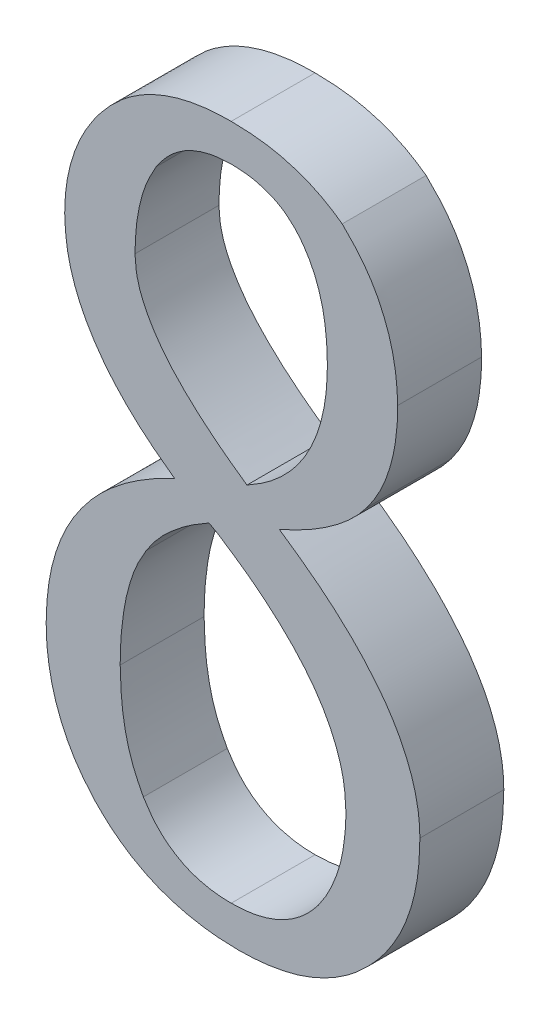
ISO-10303-21;
HEADER;
FILE_DESCRIPTION(('STEP AP214'),'2;1');
FILE_NAME('part.step','',(''),(''),'','','');
FILE_SCHEMA(('AUTOMOTIVE_DESIGN { 1 0 10303 214 1 1 1 1 }'));
ENDSEC;
DATA;
#1=APPLICATION_CONTEXT('core data for automotive mechanical design processes');
#2=APPLICATION_PROTOCOL_DEFINITION('international standard','automotive_design',2000,#1);
#3=PRODUCT_CONTEXT('',#1,'mechanical');
#4=PRODUCT('Part','Part','',(#3));
#5=PRODUCT_RELATED_PRODUCT_CATEGORY('part','',(#4));
#6=PRODUCT_DEFINITION_FORMATION('','',#4);
#7=PRODUCT_DEFINITION_CONTEXT('part definition',#1,'design');
#8=PRODUCT_DEFINITION('design','',#6,#7);
#9=PRODUCT_DEFINITION_SHAPE('','',#8);
#10=(LENGTH_UNIT() NAMED_UNIT(*) SI_UNIT(.MILLI.,.METRE.));
#11=(NAMED_UNIT(*) PLANE_ANGLE_UNIT() SI_UNIT($,.RADIAN.));
#12=(NAMED_UNIT(*) SI_UNIT($,.STERADIAN.) SOLID_ANGLE_UNIT());
#13=UNCERTAINTY_MEASURE_WITH_UNIT(LENGTH_MEASURE(1.E-05),#10,'distance_accuracy_value','');
#14=(GEOMETRIC_REPRESENTATION_CONTEXT(3) GLOBAL_UNCERTAINTY_ASSIGNED_CONTEXT((#13)) GLOBAL_UNIT_ASSIGNED_CONTEXT((#10,
#11,#12)) REPRESENTATION_CONTEXT('',''));
#15=CARTESIAN_POINT('',(0.,0.,0.));
#16=DIRECTION('',(0.,0.,1.));
#17=DIRECTION('',(1.,0.,0.));
#18=AXIS2_PLACEMENT_3D('',#15,#16,#17);
#19=CARTESIAN_POINT('',(5.98358057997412,23.560100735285,3.));
#20=DIRECTION('',(0.,0.,1.));
#21=DIRECTION('',(1.,0.,0.));
#22=AXIS2_PLACEMENT_3D('',#19,#20,#21);
#23=PLANE('',#22);
#24=CARTESIAN_POINT('',(4.00254752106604,22.2565157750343,3.));
#25=CARTESIAN_POINT('',(4.13834375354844,22.3921654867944,3.));
#26=CARTESIAN_POINT('',(4.40784165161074,22.6613726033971,3.));
#27=CARTESIAN_POINT('',(4.86380325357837,23.0041333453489,3.));
#28=CARTESIAN_POINT('',(5.35215103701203,23.2974074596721,3.));
#29=CARTESIAN_POINT('',(5.88014229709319,23.5304454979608,3.));
#30=CARTESIAN_POINT('',(6.44195670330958,23.7194958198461,3.));
#31=CARTESIAN_POINT('',(7.04164291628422,23.8492368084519,3.));
#32=CARTESIAN_POINT('',(7.67627937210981,23.9297243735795,3.));
#33=CARTESIAN_POINT('',(8.11099149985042,23.9377130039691,3.));
#34=CARTESIAN_POINT('',(8.33333333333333,23.9417989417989,3.));
#35=B_SPLINE_CURVE_WITH_KNOTS('',3,(#24,#25,#26,#27,#28,#29,#30,#31,#32,#33,#34),.UNSPECIFIED.,
.F.,.F.,(4,1,1,1,1,1,1,1,4),(0.,0.120210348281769,0.238566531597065,0.356559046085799,
0.476625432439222,0.59965409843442,0.727582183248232,0.860666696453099,1.),.UNSPECIFIED.);
#36=CARTESIAN_POINT('',(4.00254752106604,22.2565157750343,3.));
#37=VERTEX_POINT('',#36);
#38=CARTESIAN_POINT('',(8.33333333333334,23.9417989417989,3.));
#39=VERTEX_POINT('',#38);
#40=EDGE_CURVE('E386',#37,#39,#35,.T.);
#41=ORIENTED_EDGE('',*,*,#40,.F.);
#42=CARTESIAN_POINT('',(2.38095238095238,18.1216931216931,3.));
#43=CARTESIAN_POINT('',(2.38495861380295,18.3179627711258,3.));
#44=CARTESIAN_POINT('',(2.39283777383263,18.7039712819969,3.));
#45=CARTESIAN_POINT('',(2.47630314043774,19.2725852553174,3.));
#46=CARTESIAN_POINT('',(2.60087112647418,19.8210501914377,3.));
#47=CARTESIAN_POINT('',(2.78099903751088,20.3498067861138,3.));
#48=CARTESIAN_POINT('',(3.00323217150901,20.8613279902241,3.));
#49=CARTESIAN_POINT('',(3.28924193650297,21.3476591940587,3.));
#50=CARTESIAN_POINT('',(3.61324152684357,21.8222252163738,3.));
#51=CARTESIAN_POINT('',(3.8717656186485,22.1106219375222,3.));
#52=CARTESIAN_POINT('',(4.00254752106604,22.2565157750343,3.));
#53=B_SPLINE_CURVE_WITH_KNOTS('',3,(#42,#43,#44,#45,#46,#47,#48,#49,#50,#51,#52),.UNSPECIFIED.,
.F.,.F.,(4,1,1,1,1,1,1,1,4),(0.,0.129288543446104,0.254275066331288,0.37804576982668,
0.499572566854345,0.621987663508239,0.744959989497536,0.870980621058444,1.),.UNSPECIFIED.);
#54=CARTESIAN_POINT('',(2.38095238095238,18.1216931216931,3.));
#55=VERTEX_POINT('',#54);
#56=EDGE_CURVE('E532',#55,#37,#53,.T.);
#57=ORIENTED_EDGE('',*,*,#56,.F.);
#58=CARTESIAN_POINT('',(6.31491279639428,11.8704683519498,3.));
#59=CARTESIAN_POINT('',(6.00371396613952,12.0987159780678,3.));
#60=CARTESIAN_POINT('',(5.40333231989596,12.5390636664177,3.));
#61=CARTESIAN_POINT('',(4.60033138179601,13.2632335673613,3.));
#62=CARTESIAN_POINT('',(3.91515867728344,14.009207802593,3.));
#63=CARTESIAN_POINT('',(3.36012938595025,14.7855002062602,3.));
#64=CARTESIAN_POINT('',(2.9185454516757,15.5821975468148,3.));
#65=CARTESIAN_POINT('',(2.60697758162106,16.4065606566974,3.));
#66=CARTESIAN_POINT('',(2.41999976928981,17.2576390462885,3.));
#67=CARTESIAN_POINT('',(2.39398158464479,17.8333784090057,3.));
#68=CARTESIAN_POINT('',(2.38095238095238,18.1216931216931,3.));
#69=B_SPLINE_CURVE_WITH_KNOTS('',3,(#58,#59,#60,#61,#62,#63,#64,#65,#66,#67,#68),.UNSPECIFIED.,
.F.,.F.,(4,1,1,1,1,1,1,1,4),(0.,0.150484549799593,0.290322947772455,0.421117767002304,
0.544872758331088,0.661766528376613,0.775479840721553,0.887566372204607,1.),.UNSPECIFIED.);
#70=CARTESIAN_POINT('',(6.31491279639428,11.8704683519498,3.));
#71=VERTEX_POINT('',#70);
#72=EDGE_CURVE('E526',#71,#55,#69,.T.);
#73=ORIENTED_EDGE('',*,*,#72,.F.);
#74=CARTESIAN_POINT('',(1.71957671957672,5.12443660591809,3.));
#75=CARTESIAN_POINT('',(1.72353664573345,5.31400754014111,3.));
#76=CARTESIAN_POINT('',(1.73133606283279,5.68738389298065,3.));
#77=CARTESIAN_POINT('',(1.78714236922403,6.23717801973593,3.));
#78=CARTESIAN_POINT('',(1.87275148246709,6.76845467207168,3.));
#79=CARTESIAN_POINT('',(2.00284004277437,7.28012614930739,3.));
#80=CARTESIAN_POINT('',(2.16256495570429,7.7736997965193,3.));
#81=CARTESIAN_POINT('',(2.35911806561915,8.24809780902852,3.));
#82=CARTESIAN_POINT('',(2.59596534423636,8.69901779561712,3.));
#83=CARTESIAN_POINT('',(2.86588243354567,9.131608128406,3.));
#84=CARTESIAN_POINT('',(3.17092480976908,9.54404314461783,3.));
#85=CARTESIAN_POINT('',(3.51022451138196,9.93834377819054,3.));
#86=CARTESIAN_POINT('',(3.88892978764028,10.3116565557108,3.));
#87=CARTESIAN_POINT('',(4.30610064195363,10.6615129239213,3.));
#88=CARTESIAN_POINT('',(4.75375121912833,10.9985388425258,3.));
#89=CARTESIAN_POINT('',(5.24002215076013,11.3097198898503,3.));
#90=CARTESIAN_POINT('',(5.76047284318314,11.6068205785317,3.));
#91=CARTESIAN_POINT('',(6.12753809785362,11.7813677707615,3.));
#92=CARTESIAN_POINT('',(6.31491279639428,11.8704683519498,3.));
#93=B_SPLINE_CURVE_WITH_KNOTS('',3,(#74,#75,#76,#77,#78,#79,#80,#81,#82,#83,#84,#85,#86,#87,#88,
#89,#90,#91,#92),.UNSPECIFIED.,.F.,.F.,(4,1,1,1,1,1,1,1,1,1,1,1,1,1,1,1,4),(0.,
0.0654636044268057,0.128936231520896,0.190689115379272,0.251151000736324,0.311079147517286,
0.369735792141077,0.428262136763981,0.486791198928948,0.545675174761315,0.605259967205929,
0.666279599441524,0.72910745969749,0.793178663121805,0.859666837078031,0.928364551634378,1.),.UNSPECIFIED.);
#94=CARTESIAN_POINT('',(1.71957671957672,5.12443660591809,3.));
#95=VERTEX_POINT('',#94);
#96=EDGE_CURVE('E503',#95,#71,#93,.T.);
#97=ORIENTED_EDGE('',*,*,#96,.F.);
#98=CARTESIAN_POINT('',(3.43915343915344,0.494806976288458,3.));
#99=CARTESIAN_POINT('',(3.30243059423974,0.654225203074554,3.));
#100=CARTESIAN_POINT('',(3.03117427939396,0.970508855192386,3.));
#101=CARTESIAN_POINT('',(2.67621860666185,1.4818273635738,3.));
#102=CARTESIAN_POINT('',(2.38070821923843,2.02463266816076,3.));
#103=CARTESIAN_POINT('',(2.14253670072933,2.59550383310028,3.));
#104=CARTESIAN_POINT('',(1.9472267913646,3.18897495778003,3.));
#105=CARTESIAN_POINT('',(1.81924499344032,3.81215888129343,3.));
#106=CARTESIAN_POINT('',(1.73029013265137,4.4588536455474,3.));
#107=CARTESIAN_POINT('',(1.72318293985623,4.90039607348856,3.));
#108=CARTESIAN_POINT('',(1.71957671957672,5.12443660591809,3.));
#109=B_SPLINE_CURVE_WITH_KNOTS('',3,(#98,#99,#100,#101,#102,#103,#104,#105,#106,#107,#108),
.UNSPECIFIED.,.F.,.F.,(4,1,1,1,1,1,1,1,4),(0.,0.124510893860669,0.247027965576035,
0.368391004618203,0.490359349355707,0.613495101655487,0.738307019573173,0.867215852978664,1.),.UNSPECIFIED.);
#110=CARTESIAN_POINT('',(3.43915343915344,0.494806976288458,3.));
#111=VERTEX_POINT('',#110);
#112=EDGE_CURVE('E493',#111,#95,#109,.T.);
#113=ORIENTED_EDGE('',*,*,#112,.F.);
#114=CARTESIAN_POINT('',(8.5978835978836,-1.58730158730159,3.));
#115=CARTESIAN_POINT('',(8.33627271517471,-1.58074994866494,3.));
#116=CARTESIAN_POINT('',(7.82584833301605,-1.56796716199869,3.));
#117=CARTESIAN_POINT('',(7.07959594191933,-1.46706939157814,3.));
#118=CARTESIAN_POINT('',(6.37234382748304,-1.30648316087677,3.));
#119=CARTESIAN_POINT('',(5.7018480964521,-1.08323207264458,3.));
#120=CARTESIAN_POINT('',(5.07486285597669,-0.784041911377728,3.));
#121=CARTESIAN_POINT('',(4.4854214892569,-0.427154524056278,3.));
#122=CARTESIAN_POINT('',(3.93357639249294,-0.0022887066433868,3.));
#123=CARTESIAN_POINT('',(3.60544417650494,0.327617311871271,3.));
#124=CARTESIAN_POINT('',(3.43915343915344,0.494806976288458,3.));
#125=B_SPLINE_CURVE_WITH_KNOTS('',3,(#114,#115,#116,#117,#118,#119,#120,#121,#122,#123,#124),
.UNSPECIFIED.,.F.,.F.,(4,1,1,1,1,1,1,1,4),(0.,0.136954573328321,0.267209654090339,
0.393543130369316,0.516315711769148,0.636429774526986,0.756543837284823,0.876621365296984,1.),.UNSPECIFIED.);
#126=CARTESIAN_POINT('',(8.5978835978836,-1.58730158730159,3.));
#127=VERTEX_POINT('',#126);
#128=EDGE_CURVE('E483',#127,#111,#125,.T.);
#129=ORIENTED_EDGE('',*,*,#128,.F.);
#130=CARTESIAN_POINT('',(13.2618067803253,0.264550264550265,3.));
#131=CARTESIAN_POINT('',(13.1099143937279,0.11552027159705,3.));
#132=CARTESIAN_POINT('',(12.8105362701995,-0.178216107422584,3.));
#133=CARTESIAN_POINT('',(12.3065517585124,-0.552954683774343,3.));
#134=CARTESIAN_POINT('',(11.7732984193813,-0.872061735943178,3.));
#135=CARTESIAN_POINT('',(11.2029607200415,-1.13342280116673,3.));
#136=CARTESIAN_POINT('',(10.6014194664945,-1.34083113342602,3.));
#137=CARTESIAN_POINT('',(9.96157402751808,-1.47994233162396,3.));
#138=CARTESIAN_POINT('',(9.29130746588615,-1.57150537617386,3.));
#139=CARTESIAN_POINT('',(8.83171975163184,-1.58197479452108,3.));
#140=CARTESIAN_POINT('',(8.5978835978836,-1.58730158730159,3.));
#141=B_SPLINE_CURVE_WITH_KNOTS('',3,(#130,#131,#132,#133,#134,#135,#136,#137,#138,#139,#140),
.UNSPECIFIED.,.F.,.F.,(4,1,1,1,1,1,1,1,4),(0.,0.123553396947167,0.2435223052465,
0.363974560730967,0.48415728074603,0.607517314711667,0.733009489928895,0.864156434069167,1.),.UNSPECIFIED.);
#142=CARTESIAN_POINT('',(13.2618067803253,0.264550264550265,3.));
#143=VERTEX_POINT('',#142);
#144=EDGE_CURVE('E477',#143,#127,#141,.T.);
#145=ORIENTED_EDGE('',*,*,#144,.F.);
#146=CARTESIAN_POINT('',(15.0793650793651,5.12443660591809,3.));
#147=CARTESIAN_POINT('',(15.0735781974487,4.87924557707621,3.));
#148=CARTESIAN_POINT('',(15.0622783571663,4.40046970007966,3.));
#149=CARTESIAN_POINT('',(14.978158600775,3.70015748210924,3.));
#150=CARTESIAN_POINT('',(14.8370894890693,3.03542477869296,3.));
#151=CARTESIAN_POINT('',(14.635454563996,2.40744874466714,3.));
#152=CARTESIAN_POINT('',(14.3805611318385,1.81338597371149,3.));
#153=CARTESIAN_POINT('',(14.0633220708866,1.25920849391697,3.));
#154=CARTESIAN_POINT('',(13.6986189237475,0.733395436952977,3.));
#155=CARTESIAN_POINT('',(13.4078550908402,0.421308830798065,3.));
#156=CARTESIAN_POINT('',(13.2618067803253,0.264550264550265,3.));
#157=B_SPLINE_CURVE_WITH_KNOTS('',3,(#146,#147,#148,#149,#150,#151,#152,#153,#154,#155,#156),
.UNSPECIFIED.,.F.,.F.,(4,1,1,1,1,1,1,1,4),(0.,0.138084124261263,0.269632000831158,
0.396641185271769,0.52027131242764,0.640568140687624,0.760021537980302,0.879460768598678,1.),.UNSPECIFIED.);
#158=CARTESIAN_POINT('',(15.0793650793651,5.12443660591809,3.));
#159=VERTEX_POINT('',#158);
#160=EDGE_CURVE('E454',#159,#143,#157,.T.);
#161=ORIENTED_EDGE('',*,*,#160,.F.);
#162=CARTESIAN_POINT('',(10.0529100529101,12.1693121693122,3.));
#163=CARTESIAN_POINT('',(10.2564624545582,12.0303469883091,3.));
#164=CARTESIAN_POINT('',(10.6547971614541,11.7584039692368,3.));
#165=CARTESIAN_POINT('',(11.2225585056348,11.3336895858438,3.));
#166=CARTESIAN_POINT('',(11.7607191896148,10.9173544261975,3.));
#167=CARTESIAN_POINT('',(12.2460132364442,10.4829492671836,3.));
#168=CARTESIAN_POINT('',(12.703251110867,10.0578447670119,3.));
#169=CARTESIAN_POINT('',(13.1126454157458,9.62163940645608,3.));
#170=CARTESIAN_POINT('',(13.4850419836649,9.18369562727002,3.));
#171=CARTESIAN_POINT('',(13.8287876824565,8.74978036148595,3.));
#172=CARTESIAN_POINT('',(14.1179672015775,8.30310082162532,3.));
#173=CARTESIAN_POINT('',(14.378994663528,7.85960613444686,3.));
#174=CARTESIAN_POINT('',(14.5925150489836,7.40946362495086,3.));
#175=CARTESIAN_POINT('',(14.7702533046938,6.95793121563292,3.));
#176=CARTESIAN_POINT('',(14.909114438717,6.50439371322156,3.));
#177=CARTESIAN_POINT('',(15.0069104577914,6.04716019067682,3.));
#178=CARTESIAN_POINT('',(15.067913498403,5.58660381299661,3.));
#179=CARTESIAN_POINT('',(15.0755570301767,5.27812328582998,3.));
#180=CARTESIAN_POINT('',(15.0793650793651,5.12443660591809,3.));
#181=B_SPLINE_CURVE_WITH_KNOTS('',3,(#162,#163,#164,#165,#166,#167,#168,#169,#170,#171,#172,
#173,#174,#175,#176,#177,#178,#179,#180),.UNSPECIFIED.,.F.,.F.,(4,1,1,1,1,1,1,1,1,1,1,1,1,1,1,1,
4),(0.,0.0820192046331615,0.160504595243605,0.235967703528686,0.308368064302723,
0.377189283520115,0.443705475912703,0.507315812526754,0.568523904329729,0.627767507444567,
0.684262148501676,0.739690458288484,0.79338620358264,0.845654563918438,0.897357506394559,
0.948862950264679,1.),.UNSPECIFIED.);
#182=CARTESIAN_POINT('',(10.0529100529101,12.1693121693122,3.));
#183=VERTEX_POINT('',#182);
#184=EDGE_CURVE('E444',#183,#159,#181,.T.);
#185=ORIENTED_EDGE('',*,*,#184,.F.);
#186=CARTESIAN_POINT('',(13.1932196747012,14.4179894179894,3.));
#187=CARTESIAN_POINT('',(13.1085558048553,14.3102155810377,3.));
#188=CARTESIAN_POINT('',(12.9367955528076,14.0915714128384,3.));
#189=CARTESIAN_POINT('',(12.6361629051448,13.7855443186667,3.));
#190=CARTESIAN_POINT('',(12.3010030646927,13.488614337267,3.));
#191=CARTESIAN_POINT('',(11.9234993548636,13.2042875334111,3.));
#192=CARTESIAN_POINT('',(11.5141473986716,12.9234363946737,3.));
#193=CARTESIAN_POINT('',(11.0611456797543,12.6622321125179,3.));
#194=CARTESIAN_POINT('',(10.5742061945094,12.4034880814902,3.));
#195=CARTESIAN_POINT('',(10.2302450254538,12.2489743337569,3.));
#196=CARTESIAN_POINT('',(10.0529100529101,12.1693121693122,3.));
#197=B_SPLINE_CURVE_WITH_KNOTS('',3,(#186,#187,#188,#189,#190,#191,#192,#193,#194,#195,#196),
.UNSPECIFIED.,.F.,.F.,(4,1,1,1,1,1,1,1,4),(0.,0.105246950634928,0.213517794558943,
0.329091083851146,0.449063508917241,0.576452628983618,0.710321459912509,0.850651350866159,1.),.UNSPECIFIED.);
#198=CARTESIAN_POINT('',(13.1932196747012,14.4179894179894,3.));
#199=VERTEX_POINT('',#198);
#200=EDGE_CURVE('E434',#199,#183,#197,.T.);
#201=ORIENTED_EDGE('',*,*,#200,.F.);
#202=CARTESIAN_POINT('',(14.2857142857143,18.1216931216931,3.));
#203=CARTESIAN_POINT('',(14.2840053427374,17.938611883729,3.));
#204=CARTESIAN_POINT('',(14.2806557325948,17.5797638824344,3.));
#205=CARTESIAN_POINT('',(14.2216483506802,17.0550321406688,3.));
#206=CARTESIAN_POINT('',(14.1434672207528,16.552509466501,3.));
#207=CARTESIAN_POINT('',(14.0174852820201,16.077261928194,3.));
#208=CARTESIAN_POINT('',(13.8673336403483,15.6239983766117,3.));
#209=CARTESIAN_POINT('',(13.6810831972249,15.1948005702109,3.));
#210=CARTESIAN_POINT('',(13.455249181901,14.792636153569,3.));
#211=CARTESIAN_POINT('',(13.2802172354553,14.5423775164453,3.));
#212=CARTESIAN_POINT('',(13.1932196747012,14.4179894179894,3.));
#213=B_SPLINE_CURVE_WITH_KNOTS('',3,(#202,#203,#204,#205,#206,#207,#208,#209,#210,#211,#212),
.UNSPECIFIED.,.F.,.F.,(4,1,1,1,1,1,1,1,4),(0.,0.139677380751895,0.273774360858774,
0.402688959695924,0.52756794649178,0.648597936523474,0.76695304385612,0.884166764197,1.),.UNSPECIFIED.);
#214=CARTESIAN_POINT('',(14.2857142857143,18.1216931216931,3.));
#215=VERTEX_POINT('',#214);
#216=EDGE_CURVE('E428',#215,#199,#213,.T.);
#217=ORIENTED_EDGE('',*,*,#216,.F.);
#218=CARTESIAN_POINT('',(12.3015873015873,22.7513227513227,3.));
#219=CARTESIAN_POINT('',(12.4564284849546,22.5973163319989,3.));
#220=CARTESIAN_POINT('',(12.7628833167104,22.2925136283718,3.));
#221=CARTESIAN_POINT('',(13.1668689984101,21.7907478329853,3.));
#222=CARTESIAN_POINT('',(13.5069224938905,21.2547836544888,3.));
#223=CARTESIAN_POINT('',(13.7803498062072,20.68572078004,3.));
#224=CARTESIAN_POINT('',(14.0057673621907,20.0905865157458,3.));
#225=CARTESIAN_POINT('',(14.1588708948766,19.4601815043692,3.));
#226=CARTESIAN_POINT('',(14.2601485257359,18.8009531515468,3.));
#227=CARTESIAN_POINT('',(14.2770951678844,18.3506955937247,3.));
#228=CARTESIAN_POINT('',(14.2857142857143,18.1216931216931,3.));
#229=B_SPLINE_CURVE_WITH_KNOTS('',3,(#218,#219,#220,#221,#222,#223,#224,#225,#226,#227,#228),
.UNSPECIFIED.,.F.,.F.,(4,1,1,1,1,1,1,1,4),(0.,0.126309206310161,0.249985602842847,
0.371894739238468,0.492770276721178,0.614767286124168,0.739450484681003,0.86748366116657,1.),.UNSPECIFIED.);
#230=CARTESIAN_POINT('',(12.3015873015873,22.7513227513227,3.));
#231=VERTEX_POINT('',#230);
#232=EDGE_CURVE('E404',#231,#215,#229,.T.);
#233=ORIENTED_EDGE('',*,*,#232,.F.);
#234=CARTESIAN_POINT('',(8.33333333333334,23.9417989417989,3.));
#235=CARTESIAN_POINT('',(8.52778089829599,23.937737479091,3.));
#236=CARTESIAN_POINT('',(8.90926549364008,23.929769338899,3.));
#237=CARTESIAN_POINT('',(9.46944282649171,23.875985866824,3.));
#238=CARTESIAN_POINT('',(10.0053013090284,23.7836715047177,3.));
#239=CARTESIAN_POINT('',(10.5144076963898,23.651043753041,3.));
#240=CARTESIAN_POINT('',(11.0000585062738,23.4839088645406,3.));
#241=CARTESIAN_POINT('',(11.4586423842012,23.2783645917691,3.));
#242=CARTESIAN_POINT('',(11.8961554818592,23.0376756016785,3.));
#243=CARTESIAN_POINT('',(12.1660913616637,22.8470223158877,3.));
#244=CARTESIAN_POINT('',(12.3015873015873,22.7513227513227,3.));
#245=B_SPLINE_CURVE_WITH_KNOTS('',3,(#234,#235,#236,#237,#238,#239,#240,#241,#242,#243,#244),
.UNSPECIFIED.,.F.,.F.,(4,1,1,1,1,1,1,1,4),(0.,0.138352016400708,0.271431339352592,
0.399995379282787,0.524845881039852,0.645377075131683,0.765008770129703,0.882044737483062,1.),.UNSPECIFIED.);
#246=EDGE_CURVE('E393',#39,#231,#245,.T.);
#247=ORIENTED_EDGE('',*,*,#246,.F.);
#248=EDGE_LOOP('',(#41,#57,#73,#97,#113,#129,#145,#161,#185,#201,#217,#233,#247));
#249=FACE_BOUND('',#248,.T.);
#250=CARTESIAN_POINT('',(7.53968253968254,11.1111111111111,3.));
#251=CARTESIAN_POINT('',(7.2939425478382,10.9684867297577,3.));
#252=CARTESIAN_POINT('',(6.82354022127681,10.6954711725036,3.));
#253=CARTESIAN_POINT('',(6.20934968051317,10.2068922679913,3.));
#254=CARTESIAN_POINT('',(5.68270482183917,9.70142290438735,3.));
#255=CARTESIAN_POINT('',(5.41902962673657,9.31473554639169,3.));
#256=CARTESIAN_POINT('',(5.29100529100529,9.12698412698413,3.));
#257=B_SPLINE_CURVE_WITH_KNOTS('',3,(#250,#251,#252,#253,#254,#255,#256),.UNSPECIFIED.,.F.,.F.,
(4,1,1,1,4),(0.,0.280919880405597,0.537744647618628,0.775557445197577,1.),.UNSPECIFIED.);
#258=CARTESIAN_POINT('',(7.53968253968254,11.1111111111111,3.));
#259=VERTEX_POINT('',#258);
#260=CARTESIAN_POINT('',(5.29100529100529,9.12698412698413,3.));
#261=VERTEX_POINT('',#260);
#262=EDGE_CURVE('E725',#259,#261,#257,.T.);
#263=ORIENTED_EDGE('',*,*,#262,.F.);
#264=DIRECTION('',(-0.87348098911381,0.486858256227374,0.));
#265=VECTOR('',#264,1.);
#266=CARTESIAN_POINT('',(7.83852635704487,10.9445424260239,3.));
#267=LINE('',#266,#265);
#268=CARTESIAN_POINT('',(7.83852635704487,10.9445424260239,3.));
#269=VERTEX_POINT('',#268);
#270=EDGE_CURVE('E357',#269,#259,#267,.T.);
#271=ORIENTED_EDGE('',*,*,#270,.F.);
#272=CARTESIAN_POINT('',(12.4338624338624,4.62962962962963,3.));
#273=CARTESIAN_POINT('',(12.4193206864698,4.91187909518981,3.));
#274=CARTESIAN_POINT('',(12.3900703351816,5.47961664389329,3.));
#275=CARTESIAN_POINT('',(12.1616406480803,6.31851611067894,3.));
#276=CARTESIAN_POINT('',(11.7985118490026,7.1395804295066,3.));
#277=CARTESIAN_POINT('',(11.291716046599,7.9444319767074,3.));
#278=CARTESIAN_POINT('',(10.6331511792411,8.72649321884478,3.));
#279=CARTESIAN_POINT('',(9.8357425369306,9.49244316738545,3.));
#280=CARTESIAN_POINT('',(8.89855876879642,10.2476125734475,3.));
#281=CARTESIAN_POINT('',(8.20203000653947,10.7055529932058,3.));
#282=CARTESIAN_POINT('',(7.83852635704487,10.9445424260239,3.));
#283=B_SPLINE_CURVE_WITH_KNOTS('',3,(#272,#273,#274,#275,#276,#277,#278,#279,#280,#281,#282),
.UNSPECIFIED.,.F.,.F.,(4,1,1,1,1,1,1,1,4),(0.,0.103796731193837,0.208784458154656,
0.317805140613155,0.433403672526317,0.55764020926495,0.693264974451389,0.83992146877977,1.),.UNSPECIFIED.);
#284=CARTESIAN_POINT('',(12.4338624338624,4.62962962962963,3.));
#285=VERTEX_POINT('',#284);
#286=EDGE_CURVE('E279',#285,#269,#283,.T.);
#287=ORIENTED_EDGE('',*,*,#286,.F.);
#288=CARTESIAN_POINT('',(11.4442484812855,1.22476974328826,3.));
#289=CARTESIAN_POINT('',(11.5232270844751,1.33931903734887,3.));
#290=CARTESIAN_POINT('',(11.6823038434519,1.57004140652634,3.));
#291=CARTESIAN_POINT('',(11.8821888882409,1.94519604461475,3.));
#292=CARTESIAN_POINT('',(12.0518030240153,2.34089537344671,3.));
#293=CARTESIAN_POINT('',(12.1969398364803,2.75563226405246,3.));
#294=CARTESIAN_POINT('',(12.3047790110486,3.19365047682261,3.));
#295=CARTESIAN_POINT('',(12.3737667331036,3.65477074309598,3.));
#296=CARTESIAN_POINT('',(12.4276224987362,4.13521265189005,3.));
#297=CARTESIAN_POINT('',(12.4317581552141,4.4628985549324,3.));
#298=CARTESIAN_POINT('',(12.4338624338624,4.62962962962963,3.));
#299=B_SPLINE_CURVE_WITH_KNOTS('',3,(#288,#289,#290,#291,#292,#293,#294,#295,#296,#297,#298),
.UNSPECIFIED.,.F.,.F.,(4,1,1,1,1,1,1,1,4),(0.,0.115684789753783,0.233009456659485,
0.352894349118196,0.473630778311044,0.598190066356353,0.72751888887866,0.861357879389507,1.),.UNSPECIFIED.);
#300=CARTESIAN_POINT('',(11.4442484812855,1.22476974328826,3.));
#301=VERTEX_POINT('',#300);
#302=EDGE_CURVE('E286',#301,#285,#299,.T.);
#303=ORIENTED_EDGE('',*,*,#302,.F.);
#304=CARTESIAN_POINT('',(8.33333333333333,-0.264550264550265,3.));
#305=CARTESIAN_POINT('',(8.49522304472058,-0.259613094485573,3.));
#306=CARTESIAN_POINT('',(8.81070871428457,-0.249991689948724,3.));
#307=CARTESIAN_POINT('',(9.26990797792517,-0.181916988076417,3.));
#308=CARTESIAN_POINT('',(9.6997526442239,-0.0622333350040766,3.));
#309=CARTESIAN_POINT('',(10.1057031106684,0.0989357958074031,3.));
#310=CARTESIAN_POINT('',(10.4836985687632,0.31092111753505,3.));
#311=CARTESIAN_POINT('',(10.8355590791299,0.569168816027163,3.));
#312=CARTESIAN_POINT('',(11.1609438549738,0.87265668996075,3.));
#313=CARTESIAN_POINT('',(11.3489927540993,1.10637850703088,3.));
#314=CARTESIAN_POINT('',(11.4442484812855,1.22476974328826,3.));
#315=B_SPLINE_CURVE_WITH_KNOTS('',3,(#304,#305,#306,#307,#308,#309,#310,#311,#312,#313,#314),
.UNSPECIFIED.,.F.,.F.,(4,1,1,1,1,1,1,1,4),(0.,0.135506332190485,0.264070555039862,
0.387442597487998,0.508274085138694,0.628834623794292,0.749139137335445,0.872927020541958,1.),.UNSPECIFIED.);
#316=CARTESIAN_POINT('',(8.33333333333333,-0.264550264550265,3.));
#317=VERTEX_POINT('',#316);
#318=EDGE_CURVE('E715',#317,#301,#315,.T.);
#319=ORIENTED_EDGE('',*,*,#318,.F.);
#320=CARTESIAN_POINT('',(5.19302371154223,1.45502645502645,3.));
#321=CARTESIAN_POINT('',(5.28159847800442,1.31908896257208,3.));
#322=CARTESIAN_POINT('',(5.45492863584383,1.05307565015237,3.));
#323=CARTESIAN_POINT('',(5.75919274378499,0.695222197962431,3.));
#324=CARTESIAN_POINT('',(6.10648288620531,0.398611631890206,3.));
#325=CARTESIAN_POINT('',(6.48772879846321,0.158973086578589,3.));
#326=CARTESIAN_POINT('',(6.8981236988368,-0.038998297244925,3.));
#327=CARTESIAN_POINT('',(7.3478092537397,-0.164839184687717,3.));
#328=CARTESIAN_POINT('',(7.82839709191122,-0.254960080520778,3.));
#329=CARTESIAN_POINT('',(8.16140082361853,-0.261284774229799,3.));
#330=CARTESIAN_POINT('',(8.33333333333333,-0.264550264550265,3.));
#331=B_SPLINE_CURVE_WITH_KNOTS('',3,(#320,#321,#322,#323,#324,#325,#326,#327,#328,#329,#330),
.UNSPECIFIED.,.F.,.F.,(4,1,1,1,1,1,1,1,4),(0.,0.129293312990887,0.253011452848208,
0.373057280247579,0.491896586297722,0.611305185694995,0.734899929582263,0.863126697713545,1.),.UNSPECIFIED.);
#332=CARTESIAN_POINT('',(5.19302371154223,1.45502645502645,3.));
#333=VERTEX_POINT('',#332);
#334=EDGE_CURVE('E717',#333,#317,#331,.T.);
#335=ORIENTED_EDGE('',*,*,#334,.F.);
#336=CARTESIAN_POINT('',(4.36507936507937,5.12443660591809,3.));
#337=CARTESIAN_POINT('',(4.37528623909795,4.76618386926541,3.));
#338=CARTESIAN_POINT('',(4.39482190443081,4.08049836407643,3.));
#339=CARTESIAN_POINT('',(4.54548796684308,3.10430688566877,3.));
#340=CARTESIAN_POINT('',(4.79748965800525,2.22521802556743,3.));
#341=CARTESIAN_POINT('',(5.06395616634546,1.70634927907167,3.));
#342=CARTESIAN_POINT('',(5.19302371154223,1.45502645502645,3.));
#343=B_SPLINE_CURVE_WITH_KNOTS('',3,(#336,#337,#338,#339,#340,#341,#342),.UNSPECIFIED.,.F.,.F.,
(4,1,1,1,4),(0.,0.282515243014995,0.540726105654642,0.777542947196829,1.),.UNSPECIFIED.);
#344=CARTESIAN_POINT('',(4.36507936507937,5.12443660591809,3.));
#345=VERTEX_POINT('',#344);
#346=EDGE_CURVE('E719',#345,#333,#343,.T.);
#347=ORIENTED_EDGE('',*,*,#346,.F.);
#348=CARTESIAN_POINT('',(5.29100529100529,9.12698412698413,3.));
#349=CARTESIAN_POINT('',(5.2172526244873,9.00066086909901,3.));
#350=CARTESIAN_POINT('',(5.06722916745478,8.74370132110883,3.));
#351=CARTESIAN_POINT('',(4.87317352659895,8.32928633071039,3.));
#352=CARTESIAN_POINT('',(4.72114180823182,7.87567441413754,3.));
#353=CARTESIAN_POINT('',(4.58604037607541,7.39261300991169,3.));
#354=CARTESIAN_POINT('',(4.49136391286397,6.87232807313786,3.));
#355=CARTESIAN_POINT('',(4.41752141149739,6.32154916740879,3.));
#356=CARTESIAN_POINT('',(4.37286489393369,5.73428366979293,3.));
#357=CARTESIAN_POINT('',(4.36772802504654,5.33190838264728,3.));
#358=CARTESIAN_POINT('',(4.36507936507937,5.12443660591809,3.));
#359=B_SPLINE_CURVE_WITH_KNOTS('',3,(#348,#349,#350,#351,#352,#353,#354,#355,#356,#357,#358),
.UNSPECIFIED.,.F.,.F.,(4,1,1,1,1,1,1,1,4),(0.,0.105427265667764,0.21445411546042,
0.329124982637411,0.449928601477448,0.575761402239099,0.709956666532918,0.850448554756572,1.),.UNSPECIFIED.);
#360=EDGE_CURVE('E722',#261,#345,#359,.T.);
#361=ORIENTED_EDGE('',*,*,#360,.F.);
#362=EDGE_LOOP('',(#263,#271,#287,#303,#319,#335,#347,#361));
#363=FACE_BOUND('',#362,.T.);
#364=CARTESIAN_POINT('',(8.89672741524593,12.962962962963,3.));
#365=CARTESIAN_POINT('',(9.12645261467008,13.0969679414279,3.));
#366=CARTESIAN_POINT('',(9.57487311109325,13.358543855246,3.));
#367=CARTESIAN_POINT('',(10.1627164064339,13.852921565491,3.));
#368=CARTESIAN_POINT('',(10.6648829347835,14.4040772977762,3.));
#369=CARTESIAN_POINT('',(11.0700687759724,15.0255552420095,3.));
#370=CARTESIAN_POINT('',(11.3860775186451,15.7089191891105,3.));
#371=CARTESIAN_POINT('',(11.6103325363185,16.4575630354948,3.));
#372=CARTESIAN_POINT('',(11.7503482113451,17.2689156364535,3.));
#373=CARTESIAN_POINT('',(11.764967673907,17.8320574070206,3.));
#374=CARTESIAN_POINT('',(11.7724867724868,18.1216931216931,3.));
#375=B_SPLINE_CURVE_WITH_KNOTS('',3,(#364,#365,#366,#367,#368,#369,#370,#371,#372,#373,#374),
.UNSPECIFIED.,.F.,.F.,(4,1,1,1,1,1,1,1,4),(0.,0.127806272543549,0.249476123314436,
0.368015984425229,0.485519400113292,0.605084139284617,0.729154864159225,0.860698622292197,1.),.UNSPECIFIED.);
#376=CARTESIAN_POINT('',(8.89672741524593,12.962962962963,3.));
#377=VERTEX_POINT('',#376);
#378=CARTESIAN_POINT('',(11.7724867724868,18.1216931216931,3.));
#379=VERTEX_POINT('',#378);
#380=EDGE_CURVE('E230',#377,#379,#375,.T.);
#381=ORIENTED_EDGE('',*,*,#380,.F.);
#382=CARTESIAN_POINT('',(4.89417989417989,18.1216931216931,3.));
#383=CARTESIAN_POINT('',(4.90762909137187,17.917953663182,3.));
#384=CARTESIAN_POINT('',(4.93537789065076,17.4975921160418,3.));
#385=CARTESIAN_POINT('',(5.13319690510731,16.8681053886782,3.));
#386=CARTESIAN_POINT('',(5.45692431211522,16.2356079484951,3.));
#387=CARTESIAN_POINT('',(5.89677892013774,15.590911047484,3.));
#388=CARTESIAN_POINT('',(6.4706234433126,14.9436588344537,3.));
#389=CARTESIAN_POINT('',(7.16435778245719,14.2845705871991,3.));
#390=CARTESIAN_POINT('',(7.98017726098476,13.6123408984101,3.));
#391=CARTESIAN_POINT('',(8.58188454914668,13.1860298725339,3.));
#392=CARTESIAN_POINT('',(8.89672741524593,12.962962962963,3.));
#393=B_SPLINE_CURVE_WITH_KNOTS('',3,(#382,#383,#384,#385,#386,#387,#388,#389,#390,#391,#392),
.UNSPECIFIED.,.F.,.F.,(4,1,1,1,1,1,1,1,4),(0.,0.0903176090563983,0.186346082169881,
0.29001344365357,0.404738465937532,0.531557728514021,0.672965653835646,0.828879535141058,1.),.UNSPECIFIED.);
#394=CARTESIAN_POINT('',(4.89417989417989,18.1216931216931,3.));
#395=VERTEX_POINT('',#394);
#396=EDGE_CURVE('E221',#395,#377,#393,.T.);
#397=ORIENTED_EDGE('',*,*,#396,.F.);
#398=CARTESIAN_POINT('',(5.65353713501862,21.1983147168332,3.));
#399=CARTESIAN_POINT('',(5.53474445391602,20.9845508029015,3.));
#400=CARTESIAN_POINT('',(5.29146074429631,20.5467689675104,3.));
#401=CARTESIAN_POINT('',(5.06580342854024,19.8024790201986,3.));
#402=CARTESIAN_POINT('',(4.91986144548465,18.9881296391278,3.));
#403=CARTESIAN_POINT('',(4.90296241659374,18.4179952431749,3.));
#404=CARTESIAN_POINT('',(4.89417989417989,18.1216931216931,3.));
#405=B_SPLINE_CURVE_WITH_KNOTS('',3,(#398,#399,#400,#401,#402,#403,#404),.UNSPECIFIED.,.F.,.F.,
(4,1,1,1,4),(0.,0.228151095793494,0.467246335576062,0.72312485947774,1.),.UNSPECIFIED.);
#406=CARTESIAN_POINT('',(5.65353713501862,21.1983147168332,3.));
#407=VERTEX_POINT('',#406);
#408=EDGE_CURVE('E742',#407,#395,#405,.T.);
#409=ORIENTED_EDGE('',*,*,#408,.F.);
#410=CARTESIAN_POINT('',(8.33333333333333,22.6190476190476,3.));
#411=CARTESIAN_POINT('',(8.19106226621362,22.6137332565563,3.));
#412=CARTESIAN_POINT('',(7.91485782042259,22.6034159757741,3.));
#413=CARTESIAN_POINT('',(7.51075295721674,22.5406528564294,3.));
#414=CARTESIAN_POINT('',(7.13531764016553,22.4261017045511,3.));
#415=CARTESIAN_POINT('',(6.78098069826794,22.2765349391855,3.));
#416=CARTESIAN_POINT('',(6.45996732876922,22.069009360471,3.));
#417=CARTESIAN_POINT('',(6.15969913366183,21.8252536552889,3.));
#418=CARTESIAN_POINT('',(5.88719483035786,21.5324341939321,3.));
#419=CARTESIAN_POINT('',(5.73259194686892,21.3113593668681,3.));
#420=CARTESIAN_POINT('',(5.65353713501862,21.1983147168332,3.));
#421=B_SPLINE_CURVE_WITH_KNOTS('',3,(#410,#411,#412,#413,#414,#415,#416,#417,#418,#419,#420),
.UNSPECIFIED.,.F.,.F.,(4,1,1,1,1,1,1,1,4),(0.,0.134521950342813,0.261160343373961,
0.385213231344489,0.504806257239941,0.623439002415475,0.745194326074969,0.869707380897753,1.),.UNSPECIFIED.);
#422=CARTESIAN_POINT('',(8.33333333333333,22.6190476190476,3.));
#423=VERTEX_POINT('',#422);
#424=EDGE_CURVE('E745',#423,#407,#421,.T.);
#425=ORIENTED_EDGE('',*,*,#424,.F.);
#426=CARTESIAN_POINT('',(10.6163041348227,21.7617087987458,3.));
#427=CARTESIAN_POINT('',(10.4719394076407,21.8958066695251,3.));
#428=CARTESIAN_POINT('',(10.1811978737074,22.1658713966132,3.));
#429=CARTESIAN_POINT('',(9.62662315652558,22.4237118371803,3.));
#430=CARTESIAN_POINT('',(9.00657325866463,22.5935498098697,3.));
#431=CARTESIAN_POINT('',(8.56490324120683,22.6102773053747,3.));
#432=CARTESIAN_POINT('',(8.33333333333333,22.6190476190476,3.));
#433=B_SPLINE_CURVE_WITH_KNOTS('',3,(#426,#427,#428,#429,#430,#431,#432),.UNSPECIFIED.,.F.,.F.,
(4,1,1,1,4),(0.,0.234612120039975,0.472494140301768,0.72342590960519,1.),.UNSPECIFIED.);
#434=CARTESIAN_POINT('',(10.6163041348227,21.7617087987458,3.));
#435=VERTEX_POINT('',#434);
#436=EDGE_CURVE('E248',#435,#423,#433,.T.);
#437=ORIENTED_EDGE('',*,*,#436,.F.);
#438=CARTESIAN_POINT('',(11.7724867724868,18.1216931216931,3.));
#439=CARTESIAN_POINT('',(11.7686456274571,18.3161705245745,3.));
#440=CARTESIAN_POINT('',(11.7611739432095,18.694462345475,3.));
#441=CARTESIAN_POINT('',(11.7056703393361,19.2443161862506,3.));
#442=CARTESIAN_POINT('',(11.6220699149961,19.758403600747,3.));
#443=CARTESIAN_POINT('',(11.4917734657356,20.2329389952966,3.));
#444=CARTESIAN_POINT('',(11.3321156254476,20.6728126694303,3.));
#445=CARTESIAN_POINT('',(11.1301667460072,21.07440827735,3.));
#446=CARTESIAN_POINT('',(10.8967011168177,21.4420869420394,3.));
#447=CARTESIAN_POINT('',(10.7089461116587,21.6561070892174,3.));
#448=CARTESIAN_POINT('',(10.6163041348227,21.7617087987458,3.));
#449=B_SPLINE_CURVE_WITH_KNOTS('',3,(#438,#439,#440,#441,#442,#443,#444,#445,#446,#447,#448),
.UNSPECIFIED.,.F.,.F.,(4,1,1,1,1,1,1,1,4),(0.,0.14914849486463,0.290119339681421,
0.423565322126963,0.548151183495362,0.66705316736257,0.781893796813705,0.892382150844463,1.),.UNSPECIFIED.);
#450=EDGE_CURVE('E244',#379,#435,#449,.T.);
#451=ORIENTED_EDGE('',*,*,#450,.F.);
#452=EDGE_LOOP('',(#381,#397,#409,#425,#437,#451));
#453=FACE_BOUND('',#452,.T.);
#454=ADVANCED_FACE('F39',(#249,#363,#453),#23,.T.);
#455=CARTESIAN_POINT('',(5.98358057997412,23.560100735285,0.));
#456=DIRECTION('',(0.,0.,1.));
#457=DIRECTION('',(1.,0.,0.));
#458=AXIS2_PLACEMENT_3D('',#455,#456,#457);
#459=PLANE('',#458);
#460=DIRECTION('',(-0.87348098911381,0.486858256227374,0.));
#461=VECTOR('',#460,1.);
#462=CARTESIAN_POINT('',(7.83852635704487,10.9445424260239,0.));
#463=LINE('',#462,#461);
#464=CARTESIAN_POINT('',(7.83852635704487,10.9445424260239,0.));
#465=VERTEX_POINT('',#464);
#466=CARTESIAN_POINT('',(7.53968253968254,11.1111111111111,0.));
#467=VERTEX_POINT('',#466);
#468=EDGE_CURVE('E239',#465,#467,#463,.T.);
#469=ORIENTED_EDGE('',*,*,#468,.T.);
#470=CARTESIAN_POINT('',(7.53968253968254,11.1111111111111,0.));
#471=CARTESIAN_POINT('',(7.2939425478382,10.9684867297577,0.));
#472=CARTESIAN_POINT('',(6.82354022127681,10.6954711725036,0.));
#473=CARTESIAN_POINT('',(6.20934968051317,10.2068922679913,0.));
#474=CARTESIAN_POINT('',(5.68270482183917,9.70142290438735,0.));
#475=CARTESIAN_POINT('',(5.41902962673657,9.31473554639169,0.));
#476=CARTESIAN_POINT('',(5.29100529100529,9.12698412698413,0.));
#477=B_SPLINE_CURVE_WITH_KNOTS('',3,(#470,#471,#472,#473,#474,#475,#476),.UNSPECIFIED.,.F.,.F.,
(4,1,1,1,4),(0.,0.280919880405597,0.537744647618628,0.775557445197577,1.),.UNSPECIFIED.);
#478=CARTESIAN_POINT('',(5.29100529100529,9.12698412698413,0.));
#479=VERTEX_POINT('',#478);
#480=EDGE_CURVE('E297',#467,#479,#477,.T.);
#481=ORIENTED_EDGE('',*,*,#480,.T.);
#482=CARTESIAN_POINT('',(5.29100529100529,9.12698412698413,0.));
#483=CARTESIAN_POINT('',(5.2172526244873,9.00066086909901,0.));
#484=CARTESIAN_POINT('',(5.06722916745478,8.74370132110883,0.));
#485=CARTESIAN_POINT('',(4.87317352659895,8.32928633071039,0.));
#486=CARTESIAN_POINT('',(4.72114180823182,7.87567441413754,0.));
#487=CARTESIAN_POINT('',(4.58604037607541,7.39261300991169,0.));
#488=CARTESIAN_POINT('',(4.49136391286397,6.87232807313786,0.));
#489=CARTESIAN_POINT('',(4.41752141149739,6.32154916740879,0.));
#490=CARTESIAN_POINT('',(4.37286489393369,5.73428366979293,0.));
#491=CARTESIAN_POINT('',(4.36772802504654,5.33190838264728,0.));
#492=CARTESIAN_POINT('',(4.36507936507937,5.12443660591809,0.));
#493=B_SPLINE_CURVE_WITH_KNOTS('',3,(#482,#483,#484,#485,#486,#487,#488,#489,#490,#491,#492),
.UNSPECIFIED.,.F.,.F.,(4,1,1,1,1,1,1,1,4),(0.,0.105427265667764,0.21445411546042,
0.329124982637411,0.449928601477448,0.575761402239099,0.709956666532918,0.850448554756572,1.),.UNSPECIFIED.);
#494=CARTESIAN_POINT('',(4.36507936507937,5.12443660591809,0.));
#495=VERTEX_POINT('',#494);
#496=EDGE_CURVE('E303',#479,#495,#493,.T.);
#497=ORIENTED_EDGE('',*,*,#496,.T.);
#498=CARTESIAN_POINT('',(4.36507936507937,5.12443660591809,0.));
#499=CARTESIAN_POINT('',(4.37528623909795,4.76618386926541,0.));
#500=CARTESIAN_POINT('',(4.39482190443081,4.08049836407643,0.));
#501=CARTESIAN_POINT('',(4.54548796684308,3.10430688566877,0.));
#502=CARTESIAN_POINT('',(4.79748965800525,2.22521802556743,0.));
#503=CARTESIAN_POINT('',(5.06395616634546,1.70634927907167,0.));
#504=CARTESIAN_POINT('',(5.19302371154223,1.45502645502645,0.));
#505=B_SPLINE_CURVE_WITH_KNOTS('',3,(#498,#499,#500,#501,#502,#503,#504),.UNSPECIFIED.,.F.,.F.,
(4,1,1,1,4),(0.,0.282515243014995,0.540726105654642,0.777542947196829,1.),.UNSPECIFIED.);
#506=CARTESIAN_POINT('',(5.19302371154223,1.45502645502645,0.));
#507=VERTEX_POINT('',#506);
#508=EDGE_CURVE('E312',#495,#507,#505,.T.);
#509=ORIENTED_EDGE('',*,*,#508,.T.);
#510=CARTESIAN_POINT('',(5.19302371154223,1.45502645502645,0.));
#511=CARTESIAN_POINT('',(5.28159847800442,1.31908896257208,0.));
#512=CARTESIAN_POINT('',(5.45492863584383,1.05307565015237,0.));
#513=CARTESIAN_POINT('',(5.75919274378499,0.695222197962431,0.));
#514=CARTESIAN_POINT('',(6.10648288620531,0.398611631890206,0.));
#515=CARTESIAN_POINT('',(6.48772879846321,0.158973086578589,0.));
#516=CARTESIAN_POINT('',(6.8981236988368,-0.038998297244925,0.));
#517=CARTESIAN_POINT('',(7.3478092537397,-0.164839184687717,0.));
#518=CARTESIAN_POINT('',(7.82839709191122,-0.254960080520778,0.));
#519=CARTESIAN_POINT('',(8.16140082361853,-0.261284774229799,0.));
#520=CARTESIAN_POINT('',(8.33333333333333,-0.264550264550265,0.));
#521=B_SPLINE_CURVE_WITH_KNOTS('',3,(#510,#511,#512,#513,#514,#515,#516,#517,#518,#519,#520),
.UNSPECIFIED.,.F.,.F.,(4,1,1,1,1,1,1,1,4),(0.,0.129293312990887,0.253011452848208,
0.373057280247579,0.491896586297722,0.611305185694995,0.734899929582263,0.863126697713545,1.),.UNSPECIFIED.);
#522=CARTESIAN_POINT('',(8.33333333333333,-0.264550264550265,0.));
#523=VERTEX_POINT('',#522);
#524=EDGE_CURVE('E321',#507,#523,#521,.T.);
#525=ORIENTED_EDGE('',*,*,#524,.T.);
#526=CARTESIAN_POINT('',(8.33333333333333,-0.264550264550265,0.));
#527=CARTESIAN_POINT('',(8.49522304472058,-0.259613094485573,0.));
#528=CARTESIAN_POINT('',(8.81070871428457,-0.249991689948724,0.));
#529=CARTESIAN_POINT('',(9.26990797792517,-0.181916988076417,0.));
#530=CARTESIAN_POINT('',(9.6997526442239,-0.0622333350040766,0.));
#531=CARTESIAN_POINT('',(10.1057031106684,0.0989357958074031,0.));
#532=CARTESIAN_POINT('',(10.4836985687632,0.31092111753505,0.));
#533=CARTESIAN_POINT('',(10.8355590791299,0.569168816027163,0.));
#534=CARTESIAN_POINT('',(11.1609438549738,0.87265668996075,0.));
#535=CARTESIAN_POINT('',(11.3489927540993,1.10637850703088,0.));
#536=CARTESIAN_POINT('',(11.4442484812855,1.22476974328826,0.));
#537=B_SPLINE_CURVE_WITH_KNOTS('',3,(#526,#527,#528,#529,#530,#531,#532,#533,#534,#535,#536),
.UNSPECIFIED.,.F.,.F.,(4,1,1,1,1,1,1,1,4),(0.,0.135506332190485,0.264070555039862,
0.387442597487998,0.508274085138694,0.628834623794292,0.749139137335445,0.872927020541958,1.),.UNSPECIFIED.);
#538=CARTESIAN_POINT('',(11.4442484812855,1.22476974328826,0.));
#539=VERTEX_POINT('',#538);
#540=EDGE_CURVE('E330',#523,#539,#537,.T.);
#541=ORIENTED_EDGE('',*,*,#540,.T.);
#542=CARTESIAN_POINT('',(11.4442484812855,1.22476974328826,0.));
#543=CARTESIAN_POINT('',(11.5232270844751,1.33931903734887,0.));
#544=CARTESIAN_POINT('',(11.6823038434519,1.57004140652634,0.));
#545=CARTESIAN_POINT('',(11.8821888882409,1.94519604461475,0.));
#546=CARTESIAN_POINT('',(12.0518030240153,2.34089537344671,0.));
#547=CARTESIAN_POINT('',(12.1969398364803,2.75563226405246,0.));
#548=CARTESIAN_POINT('',(12.3047790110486,3.19365047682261,0.));
#549=CARTESIAN_POINT('',(12.3737667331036,3.65477074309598,0.));
#550=CARTESIAN_POINT('',(12.4276224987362,4.13521265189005,0.));
#551=CARTESIAN_POINT('',(12.4317581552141,4.4628985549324,0.));
#552=CARTESIAN_POINT('',(12.4338624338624,4.62962962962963,0.));
#553=B_SPLINE_CURVE_WITH_KNOTS('',3,(#542,#543,#544,#545,#546,#547,#548,#549,#550,#551,#552),
.UNSPECIFIED.,.F.,.F.,(4,1,1,1,1,1,1,1,4),(0.,0.115684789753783,0.233009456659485,
0.352894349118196,0.473630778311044,0.598190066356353,0.72751888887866,0.861357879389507,1.),.UNSPECIFIED.);
#554=CARTESIAN_POINT('',(12.4338624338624,4.62962962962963,0.));
#555=VERTEX_POINT('',#554);
#556=EDGE_CURVE('E339',#539,#555,#553,.T.);
#557=ORIENTED_EDGE('',*,*,#556,.T.);
#558=CARTESIAN_POINT('',(12.4338624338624,4.62962962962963,0.));
#559=CARTESIAN_POINT('',(12.4193206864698,4.91187909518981,0.));
#560=CARTESIAN_POINT('',(12.3900703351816,5.47961664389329,0.));
#561=CARTESIAN_POINT('',(12.1616406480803,6.31851611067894,0.));
#562=CARTESIAN_POINT('',(11.7985118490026,7.1395804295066,0.));
#563=CARTESIAN_POINT('',(11.291716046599,7.9444319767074,0.));
#564=CARTESIAN_POINT('',(10.6331511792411,8.72649321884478,0.));
#565=CARTESIAN_POINT('',(9.8357425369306,9.49244316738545,0.));
#566=CARTESIAN_POINT('',(8.89855876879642,10.2476125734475,0.));
#567=CARTESIAN_POINT('',(8.20203000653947,10.7055529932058,0.));
#568=CARTESIAN_POINT('',(7.83852635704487,10.9445424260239,0.));
#569=B_SPLINE_CURVE_WITH_KNOTS('',3,(#558,#559,#560,#561,#562,#563,#564,#565,#566,#567,#568),
.UNSPECIFIED.,.F.,.F.,(4,1,1,1,1,1,1,1,4),(0.,0.103796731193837,0.208784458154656,
0.317805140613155,0.433403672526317,0.55764020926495,0.693264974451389,0.83992146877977,1.),.UNSPECIFIED.);
#570=EDGE_CURVE('E348',#555,#465,#569,.T.);
#571=ORIENTED_EDGE('',*,*,#570,.T.);
#572=EDGE_LOOP('',(#469,#481,#497,#509,#525,#541,#557,#571));
#573=FACE_BOUND('',#572,.T.);
#574=CARTESIAN_POINT('',(4.00254752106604,22.2565157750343,0.));
#575=CARTESIAN_POINT('',(4.13834375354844,22.3921654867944,0.));
#576=CARTESIAN_POINT('',(4.40784165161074,22.6613726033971,0.));
#577=CARTESIAN_POINT('',(4.86380325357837,23.0041333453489,0.));
#578=CARTESIAN_POINT('',(5.35215103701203,23.2974074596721,0.));
#579=CARTESIAN_POINT('',(5.88014229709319,23.5304454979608,0.));
#580=CARTESIAN_POINT('',(6.44195670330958,23.7194958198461,0.));
#581=CARTESIAN_POINT('',(7.04164291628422,23.8492368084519,0.));
#582=CARTESIAN_POINT('',(7.67627937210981,23.9297243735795,0.));
#583=CARTESIAN_POINT('',(8.11099149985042,23.9377130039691,0.));
#584=CARTESIAN_POINT('',(8.33333333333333,23.9417989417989,0.));
#585=B_SPLINE_CURVE_WITH_KNOTS('',3,(#574,#575,#576,#577,#578,#579,#580,#581,#582,#583,#584),
.UNSPECIFIED.,.F.,.F.,(4,1,1,1,1,1,1,1,4),(0.,0.120210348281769,0.238566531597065,
0.356559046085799,0.476625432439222,0.59965409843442,0.727582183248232,0.860666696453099,1.),.UNSPECIFIED.);
#586=CARTESIAN_POINT('',(4.00254752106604,22.2565157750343,0.));
#587=VERTEX_POINT('',#586);
#588=CARTESIAN_POINT('',(8.33333333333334,23.9417989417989,0.));
#589=VERTEX_POINT('',#588);
#590=EDGE_CURVE('E385',#587,#589,#585,.T.);
#591=ORIENTED_EDGE('',*,*,#590,.T.);
#592=CARTESIAN_POINT('',(8.33333333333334,23.9417989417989,0.));
#593=CARTESIAN_POINT('',(8.52778089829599,23.937737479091,0.));
#594=CARTESIAN_POINT('',(8.90926549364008,23.929769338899,0.));
#595=CARTESIAN_POINT('',(9.46944282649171,23.875985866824,0.));
#596=CARTESIAN_POINT('',(10.0053013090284,23.7836715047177,0.));
#597=CARTESIAN_POINT('',(10.5144076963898,23.651043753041,0.));
#598=CARTESIAN_POINT('',(11.0000585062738,23.4839088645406,0.));
#599=CARTESIAN_POINT('',(11.4586423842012,23.2783645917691,0.));
#600=CARTESIAN_POINT('',(11.8961554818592,23.0376756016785,0.));
#601=CARTESIAN_POINT('',(12.1660913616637,22.8470223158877,0.));
#602=CARTESIAN_POINT('',(12.3015873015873,22.7513227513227,0.));
#603=B_SPLINE_CURVE_WITH_KNOTS('',3,(#592,#593,#594,#595,#596,#597,#598,#599,#600,#601,#602),
.UNSPECIFIED.,.F.,.F.,(4,1,1,1,1,1,1,1,4),(0.,0.138352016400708,0.271431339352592,
0.399995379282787,0.524845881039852,0.645377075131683,0.765008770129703,0.882044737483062,1.),.UNSPECIFIED.);
#604=CARTESIAN_POINT('',(12.3015873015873,22.7513227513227,0.));
#605=VERTEX_POINT('',#604);
#606=EDGE_CURVE('E550',#589,#605,#603,.T.);
#607=ORIENTED_EDGE('',*,*,#606,.T.);
#608=CARTESIAN_POINT('',(12.3015873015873,22.7513227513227,0.));
#609=CARTESIAN_POINT('',(12.4564284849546,22.5973163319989,0.));
#610=CARTESIAN_POINT('',(12.7628833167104,22.2925136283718,0.));
#611=CARTESIAN_POINT('',(13.1668689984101,21.7907478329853,0.));
#612=CARTESIAN_POINT('',(13.5069224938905,21.2547836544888,0.));
#613=CARTESIAN_POINT('',(13.7803498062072,20.68572078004,0.));
#614=CARTESIAN_POINT('',(14.0057673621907,20.0905865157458,0.));
#615=CARTESIAN_POINT('',(14.1588708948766,19.4601815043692,0.));
#616=CARTESIAN_POINT('',(14.2601485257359,18.8009531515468,0.));
#617=CARTESIAN_POINT('',(14.2770951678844,18.3506955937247,0.));
#618=CARTESIAN_POINT('',(14.2857142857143,18.1216931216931,0.));
#619=B_SPLINE_CURVE_WITH_KNOTS('',3,(#608,#609,#610,#611,#612,#613,#614,#615,#616,#617,#618),
.UNSPECIFIED.,.F.,.F.,(4,1,1,1,1,1,1,1,4),(0.,0.126309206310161,0.249985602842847,
0.371894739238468,0.492770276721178,0.614767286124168,0.739450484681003,0.86748366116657,1.),.UNSPECIFIED.);
#620=CARTESIAN_POINT('',(14.2857142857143,18.1216931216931,0.));
#621=VERTEX_POINT('',#620);
#622=EDGE_CURVE('E559',#605,#621,#619,.T.);
#623=ORIENTED_EDGE('',*,*,#622,.T.);
#624=CARTESIAN_POINT('',(14.2857142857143,18.1216931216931,0.));
#625=CARTESIAN_POINT('',(14.2840053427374,17.938611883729,0.));
#626=CARTESIAN_POINT('',(14.2806557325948,17.5797638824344,0.));
#627=CARTESIAN_POINT('',(14.2216483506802,17.0550321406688,0.));
#628=CARTESIAN_POINT('',(14.1434672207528,16.552509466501,0.));
#629=CARTESIAN_POINT('',(14.0174852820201,16.077261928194,0.));
#630=CARTESIAN_POINT('',(13.8673336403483,15.6239983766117,0.));
#631=CARTESIAN_POINT('',(13.6810831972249,15.1948005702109,0.));
#632=CARTESIAN_POINT('',(13.455249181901,14.792636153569,0.));
#633=CARTESIAN_POINT('',(13.2802172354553,14.5423775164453,0.));
#634=CARTESIAN_POINT('',(13.1932196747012,14.4179894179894,0.));
#635=B_SPLINE_CURVE_WITH_KNOTS('',3,(#624,#625,#626,#627,#628,#629,#630,#631,#632,#633,#634),
.UNSPECIFIED.,.F.,.F.,(4,1,1,1,1,1,1,1,4),(0.,0.139677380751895,0.273774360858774,
0.402688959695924,0.52756794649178,0.648597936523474,0.76695304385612,0.884166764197,1.),.UNSPECIFIED.);
#636=CARTESIAN_POINT('',(13.1932196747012,14.4179894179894,0.));
#637=VERTEX_POINT('',#636);
#638=EDGE_CURVE('E568',#621,#637,#635,.T.);
#639=ORIENTED_EDGE('',*,*,#638,.T.);
#640=CARTESIAN_POINT('',(13.1932196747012,14.4179894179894,0.));
#641=CARTESIAN_POINT('',(13.1085558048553,14.3102155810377,0.));
#642=CARTESIAN_POINT('',(12.9367955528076,14.0915714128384,0.));
#643=CARTESIAN_POINT('',(12.6361629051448,13.7855443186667,0.));
#644=CARTESIAN_POINT('',(12.3010030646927,13.488614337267,0.));
#645=CARTESIAN_POINT('',(11.9234993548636,13.2042875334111,0.));
#646=CARTESIAN_POINT('',(11.5141473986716,12.9234363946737,0.));
#647=CARTESIAN_POINT('',(11.0611456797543,12.6622321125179,0.));
#648=CARTESIAN_POINT('',(10.5742061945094,12.4034880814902,0.));
#649=CARTESIAN_POINT('',(10.2302450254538,12.2489743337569,0.));
#650=CARTESIAN_POINT('',(10.0529100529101,12.1693121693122,0.));
#651=B_SPLINE_CURVE_WITH_KNOTS('',3,(#640,#641,#642,#643,#644,#645,#646,#647,#648,#649,#650),
.UNSPECIFIED.,.F.,.F.,(4,1,1,1,1,1,1,1,4),(0.,0.105246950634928,0.213517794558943,
0.329091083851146,0.449063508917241,0.576452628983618,0.710321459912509,0.850651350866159,1.),.UNSPECIFIED.);
#652=CARTESIAN_POINT('',(10.0529100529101,12.1693121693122,0.));
#653=VERTEX_POINT('',#652);
#654=EDGE_CURVE('E577',#637,#653,#651,.T.);
#655=ORIENTED_EDGE('',*,*,#654,.T.);
#656=CARTESIAN_POINT('',(10.0529100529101,12.1693121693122,0.));
#657=CARTESIAN_POINT('',(10.2564624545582,12.0303469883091,0.));
#658=CARTESIAN_POINT('',(10.6547971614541,11.7584039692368,0.));
#659=CARTESIAN_POINT('',(11.2225585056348,11.3336895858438,0.));
#660=CARTESIAN_POINT('',(11.7607191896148,10.9173544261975,0.));
#661=CARTESIAN_POINT('',(12.2460132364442,10.4829492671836,0.));
#662=CARTESIAN_POINT('',(12.703251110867,10.0578447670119,0.));
#663=CARTESIAN_POINT('',(13.1126454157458,9.62163940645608,0.));
#664=CARTESIAN_POINT('',(13.4850419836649,9.18369562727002,0.));
#665=CARTESIAN_POINT('',(13.8287876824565,8.74978036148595,0.));
#666=CARTESIAN_POINT('',(14.1179672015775,8.30310082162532,0.));
#667=CARTESIAN_POINT('',(14.378994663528,7.85960613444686,0.));
#668=CARTESIAN_POINT('',(14.5925150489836,7.40946362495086,0.));
#669=CARTESIAN_POINT('',(14.7702533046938,6.95793121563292,0.));
#670=CARTESIAN_POINT('',(14.909114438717,6.50439371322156,0.));
#671=CARTESIAN_POINT('',(15.0069104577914,6.04716019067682,0.));
#672=CARTESIAN_POINT('',(15.067913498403,5.58660381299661,0.));
#673=CARTESIAN_POINT('',(15.0755570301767,5.27812328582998,0.));
#674=CARTESIAN_POINT('',(15.0793650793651,5.12443660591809,0.));
#675=B_SPLINE_CURVE_WITH_KNOTS('',3,(#656,#657,#658,#659,#660,#661,#662,#663,#664,#665,#666,
#667,#668,#669,#670,#671,#672,#673,#674),.UNSPECIFIED.,.F.,.F.,(4,1,1,1,1,1,1,1,1,1,1,1,1,1,1,1,
4),(0.,0.0820192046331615,0.160504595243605,0.235967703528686,0.308368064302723,
0.377189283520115,0.443705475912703,0.507315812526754,0.568523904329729,0.627767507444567,
0.684262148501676,0.739690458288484,0.79338620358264,0.845654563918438,0.897357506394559,
0.948862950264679,1.),.UNSPECIFIED.);
#676=CARTESIAN_POINT('',(15.0793650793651,5.12443660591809,0.));
#677=VERTEX_POINT('',#676);
#678=EDGE_CURVE('E586',#653,#677,#675,.T.);
#679=ORIENTED_EDGE('',*,*,#678,.T.);
#680=CARTESIAN_POINT('',(15.0793650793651,5.12443660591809,0.));
#681=CARTESIAN_POINT('',(15.0735781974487,4.87924557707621,0.));
#682=CARTESIAN_POINT('',(15.0622783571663,4.40046970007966,0.));
#683=CARTESIAN_POINT('',(14.978158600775,3.70015748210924,0.));
#684=CARTESIAN_POINT('',(14.8370894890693,3.03542477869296,0.));
#685=CARTESIAN_POINT('',(14.635454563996,2.40744874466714,0.));
#686=CARTESIAN_POINT('',(14.3805611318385,1.81338597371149,0.));
#687=CARTESIAN_POINT('',(14.0633220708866,1.25920849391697,0.));
#688=CARTESIAN_POINT('',(13.6986189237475,0.733395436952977,0.));
#689=CARTESIAN_POINT('',(13.4078550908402,0.421308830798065,0.));
#690=CARTESIAN_POINT('',(13.2618067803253,0.264550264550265,0.));
#691=B_SPLINE_CURVE_WITH_KNOTS('',3,(#680,#681,#682,#683,#684,#685,#686,#687,#688,#689,#690),
.UNSPECIFIED.,.F.,.F.,(4,1,1,1,1,1,1,1,4),(0.,0.138084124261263,0.269632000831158,
0.396641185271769,0.52027131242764,0.640568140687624,0.760021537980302,0.879460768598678,1.),.UNSPECIFIED.);
#692=CARTESIAN_POINT('',(13.2618067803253,0.264550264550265,0.));
#693=VERTEX_POINT('',#692);
#694=EDGE_CURVE('E595',#677,#693,#691,.T.);
#695=ORIENTED_EDGE('',*,*,#694,.T.);
#696=CARTESIAN_POINT('',(13.2618067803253,0.264550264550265,0.));
#697=CARTESIAN_POINT('',(13.1099143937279,0.11552027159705,0.));
#698=CARTESIAN_POINT('',(12.8105362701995,-0.178216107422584,0.));
#699=CARTESIAN_POINT('',(12.3065517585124,-0.552954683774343,0.));
#700=CARTESIAN_POINT('',(11.7732984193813,-0.872061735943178,0.));
#701=CARTESIAN_POINT('',(11.2029607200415,-1.13342280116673,0.));
#702=CARTESIAN_POINT('',(10.6014194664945,-1.34083113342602,0.));
#703=CARTESIAN_POINT('',(9.96157402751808,-1.47994233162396,0.));
#704=CARTESIAN_POINT('',(9.29130746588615,-1.57150537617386,0.));
#705=CARTESIAN_POINT('',(8.83171975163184,-1.58197479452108,0.));
#706=CARTESIAN_POINT('',(8.5978835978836,-1.58730158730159,0.));
#707=B_SPLINE_CURVE_WITH_KNOTS('',3,(#696,#697,#698,#699,#700,#701,#702,#703,#704,#705,#706),
.UNSPECIFIED.,.F.,.F.,(4,1,1,1,1,1,1,1,4),(0.,0.123553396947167,0.2435223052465,
0.363974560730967,0.48415728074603,0.607517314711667,0.733009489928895,0.864156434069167,1.),.UNSPECIFIED.);
#708=CARTESIAN_POINT('',(8.5978835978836,-1.58730158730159,0.));
#709=VERTEX_POINT('',#708);
#710=EDGE_CURVE('E604',#693,#709,#707,.T.);
#711=ORIENTED_EDGE('',*,*,#710,.T.);
#712=CARTESIAN_POINT('',(8.5978835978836,-1.58730158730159,0.));
#713=CARTESIAN_POINT('',(8.33627271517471,-1.58074994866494,0.));
#714=CARTESIAN_POINT('',(7.82584833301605,-1.56796716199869,0.));
#715=CARTESIAN_POINT('',(7.07959594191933,-1.46706939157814,0.));
#716=CARTESIAN_POINT('',(6.37234382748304,-1.30648316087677,0.));
#717=CARTESIAN_POINT('',(5.7018480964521,-1.08323207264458,0.));
#718=CARTESIAN_POINT('',(5.07486285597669,-0.784041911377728,0.));
#719=CARTESIAN_POINT('',(4.4854214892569,-0.427154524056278,0.));
#720=CARTESIAN_POINT('',(3.93357639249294,-0.0022887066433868,0.));
#721=CARTESIAN_POINT('',(3.60544417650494,0.327617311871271,0.));
#722=CARTESIAN_POINT('',(3.43915343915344,0.494806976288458,0.));
#723=B_SPLINE_CURVE_WITH_KNOTS('',3,(#712,#713,#714,#715,#716,#717,#718,#719,#720,#721,#722),
.UNSPECIFIED.,.F.,.F.,(4,1,1,1,1,1,1,1,4),(0.,0.136954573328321,0.267209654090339,
0.393543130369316,0.516315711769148,0.636429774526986,0.756543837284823,0.876621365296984,1.),.UNSPECIFIED.);
#724=CARTESIAN_POINT('',(3.43915343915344,0.494806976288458,0.));
#725=VERTEX_POINT('',#724);
#726=EDGE_CURVE('E613',#709,#725,#723,.T.);
#727=ORIENTED_EDGE('',*,*,#726,.T.);
#728=CARTESIAN_POINT('',(3.43915343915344,0.494806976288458,0.));
#729=CARTESIAN_POINT('',(3.30243059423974,0.654225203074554,0.));
#730=CARTESIAN_POINT('',(3.03117427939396,0.970508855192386,0.));
#731=CARTESIAN_POINT('',(2.67621860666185,1.4818273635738,0.));
#732=CARTESIAN_POINT('',(2.38070821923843,2.02463266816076,0.));
#733=CARTESIAN_POINT('',(2.14253670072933,2.59550383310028,0.));
#734=CARTESIAN_POINT('',(1.9472267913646,3.18897495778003,0.));
#735=CARTESIAN_POINT('',(1.81924499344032,3.81215888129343,0.));
#736=CARTESIAN_POINT('',(1.73029013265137,4.4588536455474,0.));
#737=CARTESIAN_POINT('',(1.72318293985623,4.90039607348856,0.));
#738=CARTESIAN_POINT('',(1.71957671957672,5.12443660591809,0.));
#739=B_SPLINE_CURVE_WITH_KNOTS('',3,(#728,#729,#730,#731,#732,#733,#734,#735,#736,#737,#738),
.UNSPECIFIED.,.F.,.F.,(4,1,1,1,1,1,1,1,4),(0.,0.124510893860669,0.247027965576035,
0.368391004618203,0.490359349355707,0.613495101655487,0.738307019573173,0.867215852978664,1.),.UNSPECIFIED.);
#740=CARTESIAN_POINT('',(1.71957671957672,5.12443660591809,0.));
#741=VERTEX_POINT('',#740);
#742=EDGE_CURVE('E622',#725,#741,#739,.T.);
#743=ORIENTED_EDGE('',*,*,#742,.T.);
#744=CARTESIAN_POINT('',(1.71957671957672,5.12443660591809,0.));
#745=CARTESIAN_POINT('',(1.72353664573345,5.31400754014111,0.));
#746=CARTESIAN_POINT('',(1.73133606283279,5.68738389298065,0.));
#747=CARTESIAN_POINT('',(1.78714236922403,6.23717801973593,0.));
#748=CARTESIAN_POINT('',(1.87275148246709,6.76845467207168,0.));
#749=CARTESIAN_POINT('',(2.00284004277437,7.28012614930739,0.));
#750=CARTESIAN_POINT('',(2.16256495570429,7.7736997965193,0.));
#751=CARTESIAN_POINT('',(2.35911806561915,8.24809780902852,0.));
#752=CARTESIAN_POINT('',(2.59596534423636,8.69901779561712,0.));
#753=CARTESIAN_POINT('',(2.86588243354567,9.131608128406,0.));
#754=CARTESIAN_POINT('',(3.17092480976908,9.54404314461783,0.));
#755=CARTESIAN_POINT('',(3.51022451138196,9.93834377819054,0.));
#756=CARTESIAN_POINT('',(3.88892978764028,10.3116565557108,0.));
#757=CARTESIAN_POINT('',(4.30610064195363,10.6615129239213,0.));
#758=CARTESIAN_POINT('',(4.75375121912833,10.9985388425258,0.));
#759=CARTESIAN_POINT('',(5.24002215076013,11.3097198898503,0.));
#760=CARTESIAN_POINT('',(5.76047284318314,11.6068205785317,0.));
#761=CARTESIAN_POINT('',(6.12753809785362,11.7813677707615,0.));
#762=CARTESIAN_POINT('',(6.31491279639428,11.8704683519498,0.));
#763=B_SPLINE_CURVE_WITH_KNOTS('',3,(#744,#745,#746,#747,#748,#749,#750,#751,#752,#753,#754,
#755,#756,#757,#758,#759,#760,#761,#762),.UNSPECIFIED.,.F.,.F.,(4,1,1,1,1,1,1,1,1,1,1,1,1,1,1,1,
4),(0.,0.0654636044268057,0.128936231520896,0.190689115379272,0.251151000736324,
0.311079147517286,0.369735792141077,0.428262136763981,0.486791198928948,0.545675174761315,
0.605259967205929,0.666279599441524,0.72910745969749,0.793178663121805,0.859666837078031,
0.928364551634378,1.),.UNSPECIFIED.);
#764=CARTESIAN_POINT('',(6.31491279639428,11.8704683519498,0.));
#765=VERTEX_POINT('',#764);
#766=EDGE_CURVE('E631',#741,#765,#763,.T.);
#767=ORIENTED_EDGE('',*,*,#766,.T.);
#768=CARTESIAN_POINT('',(6.31491279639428,11.8704683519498,0.));
#769=CARTESIAN_POINT('',(6.00371396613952,12.0987159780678,0.));
#770=CARTESIAN_POINT('',(5.40333231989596,12.5390636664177,0.));
#771=CARTESIAN_POINT('',(4.60033138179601,13.2632335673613,0.));
#772=CARTESIAN_POINT('',(3.91515867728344,14.009207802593,0.));
#773=CARTESIAN_POINT('',(3.36012938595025,14.7855002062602,0.));
#774=CARTESIAN_POINT('',(2.9185454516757,15.5821975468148,0.));
#775=CARTESIAN_POINT('',(2.60697758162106,16.4065606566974,0.));
#776=CARTESIAN_POINT('',(2.41999976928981,17.2576390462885,0.));
#777=CARTESIAN_POINT('',(2.39398158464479,17.8333784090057,0.));
#778=CARTESIAN_POINT('',(2.38095238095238,18.1216931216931,0.));
#779=B_SPLINE_CURVE_WITH_KNOTS('',3,(#768,#769,#770,#771,#772,#773,#774,#775,#776,#777,#778),
.UNSPECIFIED.,.F.,.F.,(4,1,1,1,1,1,1,1,4),(0.,0.150484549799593,0.290322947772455,
0.421117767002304,0.544872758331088,0.661766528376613,0.775479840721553,0.887566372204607,1.),.UNSPECIFIED.);
#780=CARTESIAN_POINT('',(2.38095238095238,18.1216931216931,0.));
#781=VERTEX_POINT('',#780);
#782=EDGE_CURVE('E640',#765,#781,#779,.T.);
#783=ORIENTED_EDGE('',*,*,#782,.T.);
#784=CARTESIAN_POINT('',(2.38095238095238,18.1216931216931,0.));
#785=CARTESIAN_POINT('',(2.38495861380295,18.3179627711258,0.));
#786=CARTESIAN_POINT('',(2.39283777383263,18.7039712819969,0.));
#787=CARTESIAN_POINT('',(2.47630314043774,19.2725852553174,0.));
#788=CARTESIAN_POINT('',(2.60087112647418,19.8210501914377,0.));
#789=CARTESIAN_POINT('',(2.78099903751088,20.3498067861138,0.));
#790=CARTESIAN_POINT('',(3.00323217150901,20.8613279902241,0.));
#791=CARTESIAN_POINT('',(3.28924193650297,21.3476591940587,0.));
#792=CARTESIAN_POINT('',(3.61324152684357,21.8222252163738,0.));
#793=CARTESIAN_POINT('',(3.8717656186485,22.1106219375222,0.));
#794=CARTESIAN_POINT('',(4.00254752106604,22.2565157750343,0.));
#795=B_SPLINE_CURVE_WITH_KNOTS('',3,(#784,#785,#786,#787,#788,#789,#790,#791,#792,#793,#794),
.UNSPECIFIED.,.F.,.F.,(4,1,1,1,1,1,1,1,4),(0.,0.129288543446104,0.254275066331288,
0.37804576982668,0.499572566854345,0.621987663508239,0.744959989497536,0.870980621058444,1.),.UNSPECIFIED.);
#796=EDGE_CURVE('E394',#781,#587,#795,.T.);
#797=ORIENTED_EDGE('',*,*,#796,.T.);
#798=EDGE_LOOP('',(#591,#607,#623,#639,#655,#679,#695,#711,#727,#743,#767,#783,#797));
#799=FACE_BOUND('',#798,.T.);
#800=CARTESIAN_POINT('',(4.89417989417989,18.1216931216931,0.));
#801=CARTESIAN_POINT('',(4.90762909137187,17.917953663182,0.));
#802=CARTESIAN_POINT('',(4.93537789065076,17.4975921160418,0.));
#803=CARTESIAN_POINT('',(5.13319690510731,16.8681053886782,0.));
#804=CARTESIAN_POINT('',(5.45692431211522,16.2356079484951,0.));
#805=CARTESIAN_POINT('',(5.89677892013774,15.590911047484,0.));
#806=CARTESIAN_POINT('',(6.4706234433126,14.9436588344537,0.));
#807=CARTESIAN_POINT('',(7.16435778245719,14.2845705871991,0.));
#808=CARTESIAN_POINT('',(7.98017726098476,13.6123408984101,0.));
#809=CARTESIAN_POINT('',(8.58188454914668,13.1860298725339,0.));
#810=CARTESIAN_POINT('',(8.89672741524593,12.962962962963,0.));
#811=B_SPLINE_CURVE_WITH_KNOTS('',3,(#800,#801,#802,#803,#804,#805,#806,#807,#808,#809,#810),
.UNSPECIFIED.,.F.,.F.,(4,1,1,1,1,1,1,1,4),(0.,0.0903176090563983,0.186346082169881,
0.29001344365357,0.404738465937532,0.531557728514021,0.672965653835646,0.828879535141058,1.),.UNSPECIFIED.);
#812=CARTESIAN_POINT('',(4.89417989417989,18.1216931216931,0.));
#813=VERTEX_POINT('',#812);
#814=CARTESIAN_POINT('',(8.89672741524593,12.962962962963,0.));
#815=VERTEX_POINT('',#814);
#816=EDGE_CURVE('E66',#813,#815,#811,.T.);
#817=ORIENTED_EDGE('',*,*,#816,.T.);
#818=CARTESIAN_POINT('',(8.89672741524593,12.962962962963,0.));
#819=CARTESIAN_POINT('',(9.12645261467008,13.0969679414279,0.));
#820=CARTESIAN_POINT('',(9.57487311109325,13.358543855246,0.));
#821=CARTESIAN_POINT('',(10.1627164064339,13.852921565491,0.));
#822=CARTESIAN_POINT('',(10.6648829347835,14.4040772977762,0.));
#823=CARTESIAN_POINT('',(11.0700687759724,15.0255552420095,0.));
#824=CARTESIAN_POINT('',(11.3860775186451,15.7089191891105,0.));
#825=CARTESIAN_POINT('',(11.6103325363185,16.4575630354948,0.));
#826=CARTESIAN_POINT('',(11.7503482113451,17.2689156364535,0.));
#827=CARTESIAN_POINT('',(11.764967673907,17.8320574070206,0.));
#828=CARTESIAN_POINT('',(11.7724867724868,18.1216931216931,0.));
#829=B_SPLINE_CURVE_WITH_KNOTS('',3,(#818,#819,#820,#821,#822,#823,#824,#825,#826,#827,#828),
.UNSPECIFIED.,.F.,.F.,(4,1,1,1,1,1,1,1,4),(0.,0.127806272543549,0.249476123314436,
0.368015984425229,0.485519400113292,0.605084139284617,0.729154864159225,0.860698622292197,1.),.UNSPECIFIED.);
#830=CARTESIAN_POINT('',(11.7724867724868,18.1216931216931,0.));
#831=VERTEX_POINT('',#830);
#832=EDGE_CURVE('E237',#815,#831,#829,.T.);
#833=ORIENTED_EDGE('',*,*,#832,.T.);
#834=CARTESIAN_POINT('',(11.7724867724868,18.1216931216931,0.));
#835=CARTESIAN_POINT('',(11.7686456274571,18.3161705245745,0.));
#836=CARTESIAN_POINT('',(11.7611739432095,18.694462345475,0.));
#837=CARTESIAN_POINT('',(11.7056703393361,19.2443161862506,0.));
#838=CARTESIAN_POINT('',(11.6220699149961,19.758403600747,0.));
#839=CARTESIAN_POINT('',(11.4917734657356,20.2329389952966,0.));
#840=CARTESIAN_POINT('',(11.3321156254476,20.6728126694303,0.));
#841=CARTESIAN_POINT('',(11.1301667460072,21.07440827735,0.));
#842=CARTESIAN_POINT('',(10.8967011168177,21.4420869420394,0.));
#843=CARTESIAN_POINT('',(10.7089461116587,21.6561070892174,0.));
#844=CARTESIAN_POINT('',(10.6163041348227,21.7617087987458,0.));
#845=B_SPLINE_CURVE_WITH_KNOTS('',3,(#834,#835,#836,#837,#838,#839,#840,#841,#842,#843,#844),
.UNSPECIFIED.,.F.,.F.,(4,1,1,1,1,1,1,1,4),(0.,0.14914849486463,0.290119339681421,
0.423565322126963,0.548151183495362,0.66705316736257,0.781893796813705,0.892382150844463,1.),.UNSPECIFIED.);
#846=CARTESIAN_POINT('',(10.6163041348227,21.7617087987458,0.));
#847=VERTEX_POINT('',#846);
#848=EDGE_CURVE('E788',#831,#847,#845,.T.);
#849=ORIENTED_EDGE('',*,*,#848,.T.);
#850=CARTESIAN_POINT('',(10.6163041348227,21.7617087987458,0.));
#851=CARTESIAN_POINT('',(10.4719394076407,21.8958066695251,0.));
#852=CARTESIAN_POINT('',(10.1811978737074,22.1658713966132,0.));
#853=CARTESIAN_POINT('',(9.62662315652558,22.4237118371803,0.));
#854=CARTESIAN_POINT('',(9.00657325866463,22.5935498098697,0.));
#855=CARTESIAN_POINT('',(8.56490324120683,22.6102773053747,0.));
#856=CARTESIAN_POINT('',(8.33333333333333,22.6190476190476,0.));
#857=B_SPLINE_CURVE_WITH_KNOTS('',3,(#850,#851,#852,#853,#854,#855,#856),.UNSPECIFIED.,.F.,.F.,
(4,1,1,1,4),(0.,0.234612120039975,0.472494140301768,0.72342590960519,1.),.UNSPECIFIED.);
#858=CARTESIAN_POINT('',(8.33333333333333,22.6190476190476,0.));
#859=VERTEX_POINT('',#858);
#860=EDGE_CURVE('E797',#847,#859,#857,.T.);
#861=ORIENTED_EDGE('',*,*,#860,.T.);
#862=CARTESIAN_POINT('',(8.33333333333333,22.6190476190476,0.));
#863=CARTESIAN_POINT('',(8.19106226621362,22.6137332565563,0.));
#864=CARTESIAN_POINT('',(7.91485782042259,22.6034159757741,0.));
#865=CARTESIAN_POINT('',(7.51075295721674,22.5406528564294,0.));
#866=CARTESIAN_POINT('',(7.13531764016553,22.4261017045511,0.));
#867=CARTESIAN_POINT('',(6.78098069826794,22.2765349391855,0.));
#868=CARTESIAN_POINT('',(6.45996732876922,22.069009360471,0.));
#869=CARTESIAN_POINT('',(6.15969913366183,21.8252536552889,0.));
#870=CARTESIAN_POINT('',(5.88719483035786,21.5324341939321,0.));
#871=CARTESIAN_POINT('',(5.73259194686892,21.3113593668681,0.));
#872=CARTESIAN_POINT('',(5.65353713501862,21.1983147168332,0.));
#873=B_SPLINE_CURVE_WITH_KNOTS('',3,(#862,#863,#864,#865,#866,#867,#868,#869,#870,#871,#872),
.UNSPECIFIED.,.F.,.F.,(4,1,1,1,1,1,1,1,4),(0.,0.134521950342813,0.261160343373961,
0.385213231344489,0.504806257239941,0.623439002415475,0.745194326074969,0.869707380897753,1.),.UNSPECIFIED.);
#874=CARTESIAN_POINT('',(5.65353713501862,21.1983147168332,0.));
#875=VERTEX_POINT('',#874);
#876=EDGE_CURVE('E806',#859,#875,#873,.T.);
#877=ORIENTED_EDGE('',*,*,#876,.T.);
#878=CARTESIAN_POINT('',(5.65353713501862,21.1983147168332,0.));
#879=CARTESIAN_POINT('',(5.53474445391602,20.9845508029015,0.));
#880=CARTESIAN_POINT('',(5.29146074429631,20.5467689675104,0.));
#881=CARTESIAN_POINT('',(5.06580342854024,19.8024790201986,0.));
#882=CARTESIAN_POINT('',(4.91986144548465,18.9881296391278,0.));
#883=CARTESIAN_POINT('',(4.90296241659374,18.4179952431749,0.));
#884=CARTESIAN_POINT('',(4.89417989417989,18.1216931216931,0.));
#885=B_SPLINE_CURVE_WITH_KNOTS('',3,(#878,#879,#880,#881,#882,#883,#884),.UNSPECIFIED.,.F.,.F.,
(4,1,1,1,4),(0.,0.228151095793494,0.467246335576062,0.72312485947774,1.),.UNSPECIFIED.);
#886=EDGE_CURVE('E231',#875,#813,#885,.T.);
#887=ORIENTED_EDGE('',*,*,#886,.T.);
#888=EDGE_LOOP('',(#817,#833,#849,#861,#877,#887));
#889=FACE_BOUND('',#888,.T.);
#890=ADVANCED_FACE('F698',(#573,#799,#889),#459,.F.);
#891=DIRECTION('',(0.,0.,-1.));
#892=VECTOR('',#891,1.);
#893=SURFACE_OF_LINEAR_EXTRUSION('',#35,#892);
#894=ORIENTED_EDGE('',*,*,#590,.F.);
#895=DIRECTION('',(0.,0.,-1.));
#896=VECTOR('',#895,1.);
#897=CARTESIAN_POINT('',(4.00254752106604,22.2565157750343,3.));
#898=LINE('',#897,#896);
#899=EDGE_CURVE('E11',#37,#587,#898,.T.);
#900=ORIENTED_EDGE('',*,*,#899,.F.);
#901=ORIENTED_EDGE('',*,*,#40,.T.);
#902=DIRECTION('',(0.,0.,-1.));
#903=VECTOR('',#902,1.);
#904=CARTESIAN_POINT('',(8.33333333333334,23.9417989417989,3.));
#905=LINE('',#904,#903);
#906=EDGE_CURVE('E44',#39,#589,#905,.T.);
#907=ORIENTED_EDGE('',*,*,#906,.T.);
#908=EDGE_LOOP('',(#894,#900,#901,#907));
#909=FACE_BOUND('',#908,.T.);
#910=ADVANCED_FACE('F41',(#909),#893,.T.);
#911=DIRECTION('',(0.,0.,-1.));
#912=VECTOR('',#911,1.);
#913=SURFACE_OF_LINEAR_EXTRUSION('',#53,#912);
#914=ORIENTED_EDGE('',*,*,#796,.F.);
#915=DIRECTION('',(0.,0.,-1.));
#916=VECTOR('',#915,1.);
#917=CARTESIAN_POINT('',(2.38095238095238,18.1216931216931,3.));
#918=LINE('',#917,#916);
#919=EDGE_CURVE('E50',#55,#781,#918,.T.);
#920=ORIENTED_EDGE('',*,*,#919,.F.);
#921=ORIENTED_EDGE('',*,*,#56,.T.);
#922=ORIENTED_EDGE('',*,*,#899,.T.);
#923=EDGE_LOOP('',(#914,#920,#921,#922));
#924=FACE_BOUND('',#923,.T.);
#925=ADVANCED_FACE('F522',(#924),#913,.T.);
#926=DIRECTION('',(0.,0.,-1.));
#927=VECTOR('',#926,1.);
#928=SURFACE_OF_LINEAR_EXTRUSION('',#69,#927);
#929=ORIENTED_EDGE('',*,*,#782,.F.);
#930=DIRECTION('',(0.,0.,-1.));
#931=VECTOR('',#930,1.);
#932=CARTESIAN_POINT('',(6.31491279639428,11.8704683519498,3.));
#933=LINE('',#932,#931);
#934=EDGE_CURVE('E662',#71,#765,#933,.T.);
#935=ORIENTED_EDGE('',*,*,#934,.F.);
#936=ORIENTED_EDGE('',*,*,#72,.T.);
#937=ORIENTED_EDGE('',*,*,#919,.T.);
#938=EDGE_LOOP('',(#929,#935,#936,#937));
#939=FACE_BOUND('',#938,.T.);
#940=ADVANCED_FACE('F518',(#939),#928,.T.);
#941=DIRECTION('',(0.,0.,-1.));
#942=VECTOR('',#941,1.);
#943=SURFACE_OF_LINEAR_EXTRUSION('',#93,#942);
#944=ORIENTED_EDGE('',*,*,#766,.F.);
#945=DIRECTION('',(0.,0.,-1.));
#946=VECTOR('',#945,1.);
#947=CARTESIAN_POINT('',(1.71957671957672,5.12443660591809,3.));
#948=LINE('',#947,#946);
#949=EDGE_CURVE('E665',#95,#741,#948,.T.);
#950=ORIENTED_EDGE('',*,*,#949,.F.);
#951=ORIENTED_EDGE('',*,*,#96,.T.);
#952=ORIENTED_EDGE('',*,*,#934,.T.);
#953=EDGE_LOOP('',(#944,#950,#951,#952));
#954=FACE_BOUND('',#953,.T.);
#955=ADVANCED_FACE('F514',(#954),#943,.T.);
#956=DIRECTION('',(0.,0.,-1.));
#957=VECTOR('',#956,1.);
#958=SURFACE_OF_LINEAR_EXTRUSION('',#109,#957);
#959=ORIENTED_EDGE('',*,*,#742,.F.);
#960=DIRECTION('',(0.,0.,-1.));
#961=VECTOR('',#960,1.);
#962=CARTESIAN_POINT('',(3.43915343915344,0.494806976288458,3.));
#963=LINE('',#962,#961);
#964=EDGE_CURVE('E668',#111,#725,#963,.T.);
#965=ORIENTED_EDGE('',*,*,#964,.F.);
#966=ORIENTED_EDGE('',*,*,#112,.T.);
#967=ORIENTED_EDGE('',*,*,#949,.T.);
#968=EDGE_LOOP('',(#959,#965,#966,#967));
#969=FACE_BOUND('',#968,.T.);
#970=ADVANCED_FACE('F511',(#969),#958,.T.);
#971=DIRECTION('',(0.,0.,-1.));
#972=VECTOR('',#971,1.);
#973=SURFACE_OF_LINEAR_EXTRUSION('',#125,#972);
#974=ORIENTED_EDGE('',*,*,#726,.F.);
#975=DIRECTION('',(0.,0.,-1.));
#976=VECTOR('',#975,1.);
#977=CARTESIAN_POINT('',(8.5978835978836,-1.58730158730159,3.));
#978=LINE('',#977,#976);
#979=EDGE_CURVE('E671',#127,#709,#978,.T.);
#980=ORIENTED_EDGE('',*,*,#979,.F.);
#981=ORIENTED_EDGE('',*,*,#128,.T.);
#982=ORIENTED_EDGE('',*,*,#964,.T.);
#983=EDGE_LOOP('',(#974,#980,#981,#982));
#984=FACE_BOUND('',#983,.T.);
#985=ADVANCED_FACE('F473',(#984),#973,.T.);
#986=DIRECTION('',(0.,0.,-1.));
#987=VECTOR('',#986,1.);
#988=SURFACE_OF_LINEAR_EXTRUSION('',#141,#987);
#989=ORIENTED_EDGE('',*,*,#710,.F.);
#990=DIRECTION('',(0.,0.,-1.));
#991=VECTOR('',#990,1.);
#992=CARTESIAN_POINT('',(13.2618067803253,0.264550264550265,3.));
#993=LINE('',#992,#991);
#994=EDGE_CURVE('E674',#143,#693,#993,.T.);
#995=ORIENTED_EDGE('',*,*,#994,.F.);
#996=ORIENTED_EDGE('',*,*,#144,.T.);
#997=ORIENTED_EDGE('',*,*,#979,.T.);
#998=EDGE_LOOP('',(#989,#995,#996,#997));
#999=FACE_BOUND('',#998,.T.);
#1000=ADVANCED_FACE('F469',(#999),#988,.T.);
#1001=DIRECTION('',(0.,0.,-1.));
#1002=VECTOR('',#1001,1.);
#1003=SURFACE_OF_LINEAR_EXTRUSION('',#157,#1002);
#1004=ORIENTED_EDGE('',*,*,#694,.F.);
#1005=DIRECTION('',(0.,0.,-1.));
#1006=VECTOR('',#1005,1.);
#1007=CARTESIAN_POINT('',(15.0793650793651,5.12443660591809,3.));
#1008=LINE('',#1007,#1006);
#1009=EDGE_CURVE('E677',#159,#677,#1008,.T.);
#1010=ORIENTED_EDGE('',*,*,#1009,.F.);
#1011=ORIENTED_EDGE('',*,*,#160,.T.);
#1012=ORIENTED_EDGE('',*,*,#994,.T.);
#1013=EDGE_LOOP('',(#1004,#1010,#1011,#1012));
#1014=FACE_BOUND('',#1013,.T.);
#1015=ADVANCED_FACE('F465',(#1014),#1003,.T.);
#1016=DIRECTION('',(0.,0.,-1.));
#1017=VECTOR('',#1016,1.);
#1018=SURFACE_OF_LINEAR_EXTRUSION('',#181,#1017);
#1019=ORIENTED_EDGE('',*,*,#678,.F.);
#1020=DIRECTION('',(0.,0.,-1.));
#1021=VECTOR('',#1020,1.);
#1022=CARTESIAN_POINT('',(10.0529100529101,12.1693121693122,3.));
#1023=LINE('',#1022,#1021);
#1024=EDGE_CURVE('E680',#183,#653,#1023,.T.);
#1025=ORIENTED_EDGE('',*,*,#1024,.F.);
#1026=ORIENTED_EDGE('',*,*,#184,.T.);
#1027=ORIENTED_EDGE('',*,*,#1009,.T.);
#1028=EDGE_LOOP('',(#1019,#1025,#1026,#1027));
#1029=FACE_BOUND('',#1028,.T.);
#1030=ADVANCED_FACE('F462',(#1029),#1018,.T.);
#1031=DIRECTION('',(0.,0.,-1.));
#1032=VECTOR('',#1031,1.);
#1033=SURFACE_OF_LINEAR_EXTRUSION('',#197,#1032);
#1034=ORIENTED_EDGE('',*,*,#654,.F.);
#1035=DIRECTION('',(0.,0.,-1.));
#1036=VECTOR('',#1035,1.);
#1037=CARTESIAN_POINT('',(13.1932196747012,14.4179894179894,3.));
#1038=LINE('',#1037,#1036);
#1039=EDGE_CURVE('E683',#199,#637,#1038,.T.);
#1040=ORIENTED_EDGE('',*,*,#1039,.F.);
#1041=ORIENTED_EDGE('',*,*,#200,.T.);
#1042=ORIENTED_EDGE('',*,*,#1024,.T.);
#1043=EDGE_LOOP('',(#1034,#1040,#1041,#1042));
#1044=FACE_BOUND('',#1043,.T.);
#1045=ADVANCED_FACE('F424',(#1044),#1033,.T.);
#1046=DIRECTION('',(0.,0.,-1.));
#1047=VECTOR('',#1046,1.);
#1048=SURFACE_OF_LINEAR_EXTRUSION('',#213,#1047);
#1049=ORIENTED_EDGE('',*,*,#638,.F.);
#1050=DIRECTION('',(0.,0.,-1.));
#1051=VECTOR('',#1050,1.);
#1052=CARTESIAN_POINT('',(14.2857142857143,18.1216931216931,3.));
#1053=LINE('',#1052,#1051);
#1054=EDGE_CURVE('E686',#215,#621,#1053,.T.);
#1055=ORIENTED_EDGE('',*,*,#1054,.F.);
#1056=ORIENTED_EDGE('',*,*,#216,.T.);
#1057=ORIENTED_EDGE('',*,*,#1039,.T.);
#1058=EDGE_LOOP('',(#1049,#1055,#1056,#1057));
#1059=FACE_BOUND('',#1058,.T.);
#1060=ADVANCED_FACE('F420',(#1059),#1048,.T.);
#1061=DIRECTION('',(0.,0.,-1.));
#1062=VECTOR('',#1061,1.);
#1063=SURFACE_OF_LINEAR_EXTRUSION('',#229,#1062);
#1064=ORIENTED_EDGE('',*,*,#622,.F.);
#1065=DIRECTION('',(0.,0.,-1.));
#1066=VECTOR('',#1065,1.);
#1067=CARTESIAN_POINT('',(12.3015873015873,22.7513227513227,3.));
#1068=LINE('',#1067,#1066);
#1069=EDGE_CURVE('E688',#231,#605,#1068,.T.);
#1070=ORIENTED_EDGE('',*,*,#1069,.F.);
#1071=ORIENTED_EDGE('',*,*,#232,.T.);
#1072=ORIENTED_EDGE('',*,*,#1054,.T.);
#1073=EDGE_LOOP('',(#1064,#1070,#1071,#1072));
#1074=FACE_BOUND('',#1073,.T.);
#1075=ADVANCED_FACE('F416',(#1074),#1063,.T.);
#1076=DIRECTION('',(0.,0.,-1.));
#1077=VECTOR('',#1076,1.);
#1078=SURFACE_OF_LINEAR_EXTRUSION('',#245,#1077);
#1079=ORIENTED_EDGE('',*,*,#606,.F.);
#1080=ORIENTED_EDGE('',*,*,#906,.F.);
#1081=ORIENTED_EDGE('',*,*,#246,.T.);
#1082=ORIENTED_EDGE('',*,*,#1069,.T.);
#1083=EDGE_LOOP('',(#1079,#1080,#1081,#1082));
#1084=FACE_BOUND('',#1083,.T.);
#1085=ADVANCED_FACE('F412',(#1084),#1078,.T.);
#1086=CARTESIAN_POINT('',(7.83852635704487,10.9445424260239,3.));
#1087=DIRECTION('',(-0.486858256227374,-0.87348098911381,0.));
#1088=DIRECTION('',(0.87348098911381,-0.486858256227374,0.));
#1089=AXIS2_PLACEMENT_3D('',#1086,#1087,#1088);
#1090=PLANE('',#1089);
#1091=ORIENTED_EDGE('',*,*,#468,.F.);
#1092=DIRECTION('',(0.,0.,-1.));
#1093=VECTOR('',#1092,1.);
#1094=CARTESIAN_POINT('',(7.83852635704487,10.9445424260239,3.));
#1095=LINE('',#1094,#1093);
#1096=EDGE_CURVE('E285',#269,#465,#1095,.T.);
#1097=ORIENTED_EDGE('',*,*,#1096,.F.);
#1098=ORIENTED_EDGE('',*,*,#270,.T.);
#1099=DIRECTION('',(0.,0.,-1.));
#1100=VECTOR('',#1099,1.);
#1101=CARTESIAN_POINT('',(7.53968253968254,11.1111111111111,3.));
#1102=LINE('',#1101,#1100);
#1103=EDGE_CURVE('E382',#259,#467,#1102,.T.);
#1104=ORIENTED_EDGE('',*,*,#1103,.T.);
#1105=EDGE_LOOP('',(#1091,#1097,#1098,#1104));
#1106=FACE_BOUND('',#1105,.T.);
#1107=ADVANCED_FACE('F415',(#1106),#1090,.T.);
#1108=DIRECTION('',(0.,0.,-1.));
#1109=VECTOR('',#1108,1.);
#1110=SURFACE_OF_LINEAR_EXTRUSION('',#257,#1109);
#1111=ORIENTED_EDGE('',*,*,#480,.F.);
#1112=ORIENTED_EDGE('',*,*,#1103,.F.);
#1113=ORIENTED_EDGE('',*,*,#262,.T.);
#1114=DIRECTION('',(0.,0.,-1.));
#1115=VECTOR('',#1114,1.);
#1116=CARTESIAN_POINT('',(5.29100529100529,9.12698412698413,3.));
#1117=LINE('',#1116,#1115);
#1118=EDGE_CURVE('E379',#261,#479,#1117,.T.);
#1119=ORIENTED_EDGE('',*,*,#1118,.T.);
#1120=EDGE_LOOP('',(#1111,#1112,#1113,#1119));
#1121=FACE_BOUND('',#1120,.T.);
#1122=ADVANCED_FACE('F835',(#1121),#1110,.T.);
#1123=DIRECTION('',(0.,0.,-1.));
#1124=VECTOR('',#1123,1.);
#1125=SURFACE_OF_LINEAR_EXTRUSION('',#359,#1124);
#1126=ORIENTED_EDGE('',*,*,#496,.F.);
#1127=ORIENTED_EDGE('',*,*,#1118,.F.);
#1128=ORIENTED_EDGE('',*,*,#360,.T.);
#1129=DIRECTION('',(0.,0.,-1.));
#1130=VECTOR('',#1129,1.);
#1131=CARTESIAN_POINT('',(4.36507936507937,5.12443660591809,3.));
#1132=LINE('',#1131,#1130);
#1133=EDGE_CURVE('E376',#345,#495,#1132,.T.);
#1134=ORIENTED_EDGE('',*,*,#1133,.T.);
#1135=EDGE_LOOP('',(#1126,#1127,#1128,#1134));
#1136=FACE_BOUND('',#1135,.T.);
#1137=ADVANCED_FACE('F839',(#1136),#1125,.T.);
#1138=DIRECTION('',(0.,0.,-1.));
#1139=VECTOR('',#1138,1.);
#1140=SURFACE_OF_LINEAR_EXTRUSION('',#343,#1139);
#1141=ORIENTED_EDGE('',*,*,#508,.F.);
#1142=ORIENTED_EDGE('',*,*,#1133,.F.);
#1143=ORIENTED_EDGE('',*,*,#346,.T.);
#1144=DIRECTION('',(0.,0.,-1.));
#1145=VECTOR('',#1144,1.);
#1146=CARTESIAN_POINT('',(5.19302371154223,1.45502645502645,3.));
#1147=LINE('',#1146,#1145);
#1148=EDGE_CURVE('E373',#333,#507,#1147,.T.);
#1149=ORIENTED_EDGE('',*,*,#1148,.T.);
#1150=EDGE_LOOP('',(#1141,#1142,#1143,#1149));
#1151=FACE_BOUND('',#1150,.T.);
#1152=ADVANCED_FACE('F867',(#1151),#1140,.T.);
#1153=DIRECTION('',(0.,0.,-1.));
#1154=VECTOR('',#1153,1.);
#1155=SURFACE_OF_LINEAR_EXTRUSION('',#331,#1154);
#1156=ORIENTED_EDGE('',*,*,#524,.F.);
#1157=ORIENTED_EDGE('',*,*,#1148,.F.);
#1158=ORIENTED_EDGE('',*,*,#334,.T.);
#1159=DIRECTION('',(0.,0.,-1.));
#1160=VECTOR('',#1159,1.);
#1161=CARTESIAN_POINT('',(8.33333333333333,-0.264550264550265,3.));
#1162=LINE('',#1161,#1160);
#1163=EDGE_CURVE('E370',#317,#523,#1162,.T.);
#1164=ORIENTED_EDGE('',*,*,#1163,.T.);
#1165=EDGE_LOOP('',(#1156,#1157,#1158,#1164));
#1166=FACE_BOUND('',#1165,.T.);
#1167=ADVANCED_FACE('F872',(#1166),#1155,.T.);
#1168=DIRECTION('',(0.,0.,-1.));
#1169=VECTOR('',#1168,1.);
#1170=SURFACE_OF_LINEAR_EXTRUSION('',#315,#1169);
#1171=ORIENTED_EDGE('',*,*,#540,.F.);
#1172=ORIENTED_EDGE('',*,*,#1163,.F.);
#1173=ORIENTED_EDGE('',*,*,#318,.T.);
#1174=DIRECTION('',(0.,0.,-1.));
#1175=VECTOR('',#1174,1.);
#1176=CARTESIAN_POINT('',(11.4442484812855,1.22476974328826,3.));
#1177=LINE('',#1176,#1175);
#1178=EDGE_CURVE('E367',#301,#539,#1177,.T.);
#1179=ORIENTED_EDGE('',*,*,#1178,.T.);
#1180=EDGE_LOOP('',(#1171,#1172,#1173,#1179));
#1181=FACE_BOUND('',#1180,.T.);
#1182=ADVANCED_FACE('F876',(#1181),#1170,.T.);
#1183=DIRECTION('',(0.,0.,-1.));
#1184=VECTOR('',#1183,1.);
#1185=SURFACE_OF_LINEAR_EXTRUSION('',#299,#1184);
#1186=ORIENTED_EDGE('',*,*,#556,.F.);
#1187=ORIENTED_EDGE('',*,*,#1178,.F.);
#1188=ORIENTED_EDGE('',*,*,#302,.T.);
#1189=DIRECTION('',(0.,0.,-1.));
#1190=VECTOR('',#1189,1.);
#1191=CARTESIAN_POINT('',(12.4338624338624,4.62962962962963,3.));
#1192=LINE('',#1191,#1190);
#1193=EDGE_CURVE('E364',#285,#555,#1192,.T.);
#1194=ORIENTED_EDGE('',*,*,#1193,.T.);
#1195=EDGE_LOOP('',(#1186,#1187,#1188,#1194));
#1196=FACE_BOUND('',#1195,.T.);
#1197=ADVANCED_FACE('F275',(#1196),#1185,.T.);
#1198=DIRECTION('',(0.,0.,-1.));
#1199=VECTOR('',#1198,1.);
#1200=SURFACE_OF_LINEAR_EXTRUSION('',#283,#1199);
#1201=ORIENTED_EDGE('',*,*,#570,.F.);
#1202=ORIENTED_EDGE('',*,*,#1193,.F.);
#1203=ORIENTED_EDGE('',*,*,#286,.T.);
#1204=ORIENTED_EDGE('',*,*,#1096,.T.);
#1205=EDGE_LOOP('',(#1201,#1202,#1203,#1204));
#1206=FACE_BOUND('',#1205,.T.);
#1207=ADVANCED_FACE('F271',(#1206),#1200,.T.);
#1208=DIRECTION('',(0.,0.,-1.));
#1209=VECTOR('',#1208,1.);
#1210=SURFACE_OF_LINEAR_EXTRUSION('',#393,#1209);
#1211=ORIENTED_EDGE('',*,*,#816,.F.);
#1212=DIRECTION('',(0.,0.,-1.));
#1213=VECTOR('',#1212,1.);
#1214=CARTESIAN_POINT('',(4.89417989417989,18.1216931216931,3.));
#1215=LINE('',#1214,#1213);
#1216=EDGE_CURVE('E225',#395,#813,#1215,.T.);
#1217=ORIENTED_EDGE('',*,*,#1216,.F.);
#1218=ORIENTED_EDGE('',*,*,#396,.T.);
#1219=DIRECTION('',(0.,0.,-1.));
#1220=VECTOR('',#1219,1.);
#1221=CARTESIAN_POINT('',(8.89672741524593,12.962962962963,3.));
#1222=LINE('',#1221,#1220);
#1223=EDGE_CURVE('E224',#377,#815,#1222,.T.);
#1224=ORIENTED_EDGE('',*,*,#1223,.T.);
#1225=EDGE_LOOP('',(#1211,#1217,#1218,#1224));
#1226=FACE_BOUND('',#1225,.T.);
#1227=ADVANCED_FACE('F223',(#1226),#1210,.T.);
#1228=DIRECTION('',(0.,0.,-1.));
#1229=VECTOR('',#1228,1.);
#1230=SURFACE_OF_LINEAR_EXTRUSION('',#375,#1229);
#1231=ORIENTED_EDGE('',*,*,#832,.F.);
#1232=ORIENTED_EDGE('',*,*,#1223,.F.);
#1233=ORIENTED_EDGE('',*,*,#380,.T.);
#1234=DIRECTION('',(0.,0.,-1.));
#1235=VECTOR('',#1234,1.);
#1236=CARTESIAN_POINT('',(11.7724867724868,18.1216931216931,3.));
#1237=LINE('',#1236,#1235);
#1238=EDGE_CURVE('E240',#379,#831,#1237,.T.);
#1239=ORIENTED_EDGE('',*,*,#1238,.T.);
#1240=EDGE_LOOP('',(#1231,#1232,#1233,#1239));
#1241=FACE_BOUND('',#1240,.T.);
#1242=ADVANCED_FACE('F234',(#1241),#1230,.T.);
#1243=DIRECTION('',(0.,0.,-1.));
#1244=VECTOR('',#1243,1.);
#1245=SURFACE_OF_LINEAR_EXTRUSION('',#449,#1244);
#1246=ORIENTED_EDGE('',*,*,#848,.F.);
#1247=ORIENTED_EDGE('',*,*,#1238,.F.);
#1248=ORIENTED_EDGE('',*,*,#450,.T.);
#1249=DIRECTION('',(0.,0.,-1.));
#1250=VECTOR('',#1249,1.);
#1251=CARTESIAN_POINT('',(10.6163041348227,21.7617087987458,3.));
#1252=LINE('',#1251,#1250);
#1253=EDGE_CURVE('E732',#435,#847,#1252,.T.);
#1254=ORIENTED_EDGE('',*,*,#1253,.T.);
#1255=EDGE_LOOP('',(#1246,#1247,#1248,#1254));
#1256=FACE_BOUND('',#1255,.T.);
#1257=ADVANCED_FACE('F267',(#1256),#1245,.T.);
#1258=DIRECTION('',(0.,0.,-1.));
#1259=VECTOR('',#1258,1.);
#1260=SURFACE_OF_LINEAR_EXTRUSION('',#433,#1259);
#1261=ORIENTED_EDGE('',*,*,#860,.F.);
#1262=ORIENTED_EDGE('',*,*,#1253,.F.);
#1263=ORIENTED_EDGE('',*,*,#436,.T.);
#1264=DIRECTION('',(0.,0.,-1.));
#1265=VECTOR('',#1264,1.);
#1266=CARTESIAN_POINT('',(8.33333333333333,22.6190476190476,3.));
#1267=LINE('',#1266,#1265);
#1268=EDGE_CURVE('E735',#423,#859,#1267,.T.);
#1269=ORIENTED_EDGE('',*,*,#1268,.T.);
#1270=EDGE_LOOP('',(#1261,#1262,#1263,#1269));
#1271=FACE_BOUND('',#1270,.T.);
#1272=ADVANCED_FACE('F761',(#1271),#1260,.T.);
#1273=DIRECTION('',(0.,0.,-1.));
#1274=VECTOR('',#1273,1.);
#1275=SURFACE_OF_LINEAR_EXTRUSION('',#421,#1274);
#1276=ORIENTED_EDGE('',*,*,#876,.F.);
#1277=ORIENTED_EDGE('',*,*,#1268,.F.);
#1278=ORIENTED_EDGE('',*,*,#424,.T.);
#1279=DIRECTION('',(0.,0.,-1.));
#1280=VECTOR('',#1279,1.);
#1281=CARTESIAN_POINT('',(5.65353713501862,21.1983147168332,3.));
#1282=LINE('',#1281,#1280);
#1283=EDGE_CURVE('E58',#407,#875,#1282,.T.);
#1284=ORIENTED_EDGE('',*,*,#1283,.T.);
#1285=EDGE_LOOP('',(#1276,#1277,#1278,#1284));
#1286=FACE_BOUND('',#1285,.T.);
#1287=ADVANCED_FACE('F764',(#1286),#1275,.T.);
#1288=DIRECTION('',(0.,0.,-1.));
#1289=VECTOR('',#1288,1.);
#1290=SURFACE_OF_LINEAR_EXTRUSION('',#405,#1289);
#1291=ORIENTED_EDGE('',*,*,#886,.F.);
#1292=ORIENTED_EDGE('',*,*,#1283,.F.);
#1293=ORIENTED_EDGE('',*,*,#408,.T.);
#1294=ORIENTED_EDGE('',*,*,#1216,.T.);
#1295=EDGE_LOOP('',(#1291,#1292,#1293,#1294));
#1296=FACE_BOUND('',#1295,.T.);
#1297=ADVANCED_FACE('F767',(#1296),#1290,.T.);
#1298=CLOSED_SHELL('',(#454,#890,#910,#925,#940,#955,#970,#985,#1000,#1015,#1030,#1045,#1060,
#1075,#1085,#1107,#1122,#1137,#1152,#1167,#1182,#1197,#1207,#1227,#1242,#1257,#1272,#1287,#1297));
#1299=MANIFOLD_SOLID_BREP('B2',#1298);
#1300=ADVANCED_BREP_SHAPE_REPRESENTATION('',(#18,#1299),#14);
#1301=SHAPE_DEFINITION_REPRESENTATION(#9,#1300);
ENDSEC;
END-ISO-10303-21;
